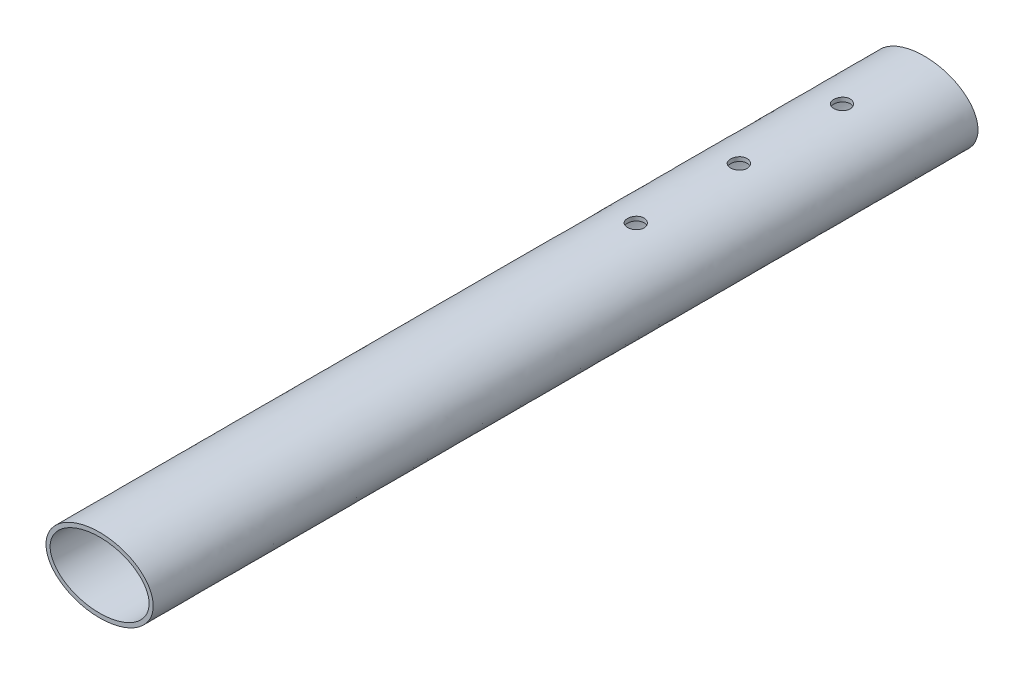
ISO-10303-21;
HEADER;
FILE_DESCRIPTION(('STEP AP214'),'2;1');
FILE_NAME('part.step','',(''),(''),'','','');
FILE_SCHEMA(('AUTOMOTIVE_DESIGN { 1 0 10303 214 1 1 1 1 }'));
ENDSEC;
DATA;
#1=APPLICATION_CONTEXT('core data for automotive mechanical design processes');
#2=APPLICATION_PROTOCOL_DEFINITION('international standard','automotive_design',2000,#1);
#3=PRODUCT_CONTEXT('',#1,'mechanical');
#4=PRODUCT('Part','Part','',(#3));
#5=PRODUCT_RELATED_PRODUCT_CATEGORY('part','',(#4));
#6=PRODUCT_DEFINITION_FORMATION('','',#4);
#7=PRODUCT_DEFINITION_CONTEXT('part definition',#1,'design');
#8=PRODUCT_DEFINITION('design','',#6,#7);
#9=PRODUCT_DEFINITION_SHAPE('','',#8);
#10=(LENGTH_UNIT() NAMED_UNIT(*) SI_UNIT(.MILLI.,.METRE.));
#11=(NAMED_UNIT(*) PLANE_ANGLE_UNIT() SI_UNIT($,.RADIAN.));
#12=(NAMED_UNIT(*) SI_UNIT($,.STERADIAN.) SOLID_ANGLE_UNIT());
#13=UNCERTAINTY_MEASURE_WITH_UNIT(LENGTH_MEASURE(1.E-05),#10,'distance_accuracy_value','');
#14=(GEOMETRIC_REPRESENTATION_CONTEXT(3) GLOBAL_UNCERTAINTY_ASSIGNED_CONTEXT((#13)) GLOBAL_UNIT_ASSIGNED_CONTEXT((#10,
#11,#12)) REPRESENTATION_CONTEXT('',''));
#15=CARTESIAN_POINT('',(0.,0.,0.));
#16=DIRECTION('',(0.,0.,1.));
#17=DIRECTION('',(1.,0.,0.));
#18=AXIS2_PLACEMENT_3D('',#15,#16,#17);
#19=CARTESIAN_POINT('',(0.,0.,200.));
#20=DIRECTION('',(0.,0.,1.));
#21=DIRECTION('',(1.,0.,0.));
#22=AXIS2_PLACEMENT_3D('',#19,#20,#21);
#23=PLANE('',#22);
#24=CARTESIAN_POINT('',(0.,0.,200.));
#25=DIRECTION('',(0.,0.,1.));
#26=DIRECTION('',(-1.,0.,0.));
#27=AXIS2_PLACEMENT_3D('',#24,#25,#26);
#28=ELLIPSE('',#27,13.,9.);
#29=CARTESIAN_POINT('',(-13.,0.,200.));
#30=VERTEX_POINT('',#29);
#31=EDGE_CURVE('E10',#30,#30,#28,.T.);
#32=ORIENTED_EDGE('',*,*,#31,.T.);
#33=EDGE_LOOP('',(#32));
#34=FACE_BOUND('',#33,.T.);
#35=CARTESIAN_POINT('',(-12.,0.,200.));
#36=CARTESIAN_POINT('',(-12.,-0.9920356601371,200.));
#37=CARTESIAN_POINT('',(-11.4421902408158,-2.9761069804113,200.));
#38=CARTESIAN_POINT('',(-8.86614178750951,-5.67990917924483,200.));
#39=CARTESIAN_POINT('',(-4.83231166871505,-7.55486933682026,200.));
#40=CARTESIAN_POINT('',(0.,-8.22256533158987,200.));
#41=CARTESIAN_POINT('',(4.83231166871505,-7.55486933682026,200.));
#42=CARTESIAN_POINT('',(8.86614178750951,-5.67990917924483,200.));
#43=CARTESIAN_POINT('',(11.4421902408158,-2.9761069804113,200.));
#44=CARTESIAN_POINT('',(12.2789048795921,0.,200.));
#45=CARTESIAN_POINT('',(11.4421902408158,2.9761069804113,200.));
#46=CARTESIAN_POINT('',(8.86614178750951,5.67990917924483,200.));
#47=CARTESIAN_POINT('',(4.83231166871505,7.55486933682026,200.));
#48=CARTESIAN_POINT('',(0.,8.22256533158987,200.));
#49=CARTESIAN_POINT('',(-4.83231166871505,7.55486933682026,200.));
#50=CARTESIAN_POINT('',(-8.86614178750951,5.67990917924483,200.));
#51=CARTESIAN_POINT('',(-11.4421902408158,2.9761069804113,200.));
#52=CARTESIAN_POINT('',(-12.,0.992035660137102,200.));
#53=CARTESIAN_POINT('',(-12.,0.,200.));
#54=B_SPLINE_CURVE_WITH_KNOTS('',3,(#35,#36,#37,#38,#39,#40,#41,#42,#43,#44,#45,#46,#47,#48,#49,
#50,#51,#52,#53),.UNSPECIFIED.,.T.,.F.,(4,1,1,1,1,1,1,1,1,1,1,1,1,1,1,1,4),(0.,
0.392699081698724,0.785398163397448,1.17809724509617,1.5707963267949,1.96349540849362,
2.35619449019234,2.74889357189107,3.14159265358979,3.53429173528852,3.92699081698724,
4.31968989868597,4.71238898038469,5.10508806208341,5.49778714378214,5.89048622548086,
6.28318530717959),.UNSPECIFIED.);
#55=CARTESIAN_POINT('',(-12.,0.,200.));
#56=VERTEX_POINT('',#55);
#57=EDGE_CURVE('E51',#56,#56,#54,.T.);
#58=ORIENTED_EDGE('',*,*,#57,.F.);
#59=EDGE_LOOP('',(#58));
#60=FACE_BOUND('',#59,.T.);
#61=ADVANCED_FACE('F32',(#34,#60),#23,.T.);
#62=CARTESIAN_POINT('',(0.,0.,0.));
#63=DIRECTION('',(0.,0.,1.));
#64=DIRECTION('',(1.,0.,0.));
#65=AXIS2_PLACEMENT_3D('',#62,#63,#64);
#66=PLANE('',#65);
#67=CARTESIAN_POINT('',(0.,0.,0.));
#68=DIRECTION('',(0.,0.,1.));
#69=DIRECTION('',(-1.,0.,0.));
#70=AXIS2_PLACEMENT_3D('',#67,#68,#69);
#71=ELLIPSE('',#70,13.,9.);
#72=CARTESIAN_POINT('',(-13.,0.,0.));
#73=VERTEX_POINT('',#72);
#74=EDGE_CURVE('E47',#73,#73,#71,.T.);
#75=ORIENTED_EDGE('',*,*,#74,.F.);
#76=EDGE_LOOP('',(#75));
#77=FACE_BOUND('',#76,.T.);
#78=CARTESIAN_POINT('',(-12.,0.,0.));
#79=CARTESIAN_POINT('',(-12.,-0.9920356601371,0.));
#80=CARTESIAN_POINT('',(-11.4421902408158,-2.9761069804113,0.));
#81=CARTESIAN_POINT('',(-8.86614178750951,-5.67990917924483,0.));
#82=CARTESIAN_POINT('',(-4.83231166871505,-7.55486933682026,0.));
#83=CARTESIAN_POINT('',(0.,-8.22256533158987,0.));
#84=CARTESIAN_POINT('',(4.83231166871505,-7.55486933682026,0.));
#85=CARTESIAN_POINT('',(8.86614178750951,-5.67990917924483,0.));
#86=CARTESIAN_POINT('',(11.4421902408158,-2.9761069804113,0.));
#87=CARTESIAN_POINT('',(12.2789048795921,0.,0.));
#88=CARTESIAN_POINT('',(11.4421902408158,2.9761069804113,0.));
#89=CARTESIAN_POINT('',(8.86614178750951,5.67990917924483,0.));
#90=CARTESIAN_POINT('',(4.83231166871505,7.55486933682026,0.));
#91=CARTESIAN_POINT('',(0.,8.22256533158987,0.));
#92=CARTESIAN_POINT('',(-4.83231166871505,7.55486933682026,0.));
#93=CARTESIAN_POINT('',(-8.86614178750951,5.67990917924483,0.));
#94=CARTESIAN_POINT('',(-11.4421902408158,2.9761069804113,0.));
#95=CARTESIAN_POINT('',(-12.,0.992035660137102,0.));
#96=CARTESIAN_POINT('',(-12.,0.,0.));
#97=B_SPLINE_CURVE_WITH_KNOTS('',3,(#78,#79,#80,#81,#82,#83,#84,#85,#86,#87,#88,#89,#90,#91,#92,
#93,#94,#95,#96),.UNSPECIFIED.,.T.,.F.,(4,1,1,1,1,1,1,1,1,1,1,1,1,1,1,1,4),(0.,
0.392699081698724,0.785398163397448,1.17809724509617,1.5707963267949,1.96349540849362,
2.35619449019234,2.74889357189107,3.14159265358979,3.53429173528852,3.92699081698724,
4.31968989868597,4.71238898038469,5.10508806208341,5.49778714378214,5.89048622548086,
6.28318530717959),.UNSPECIFIED.);
#98=CARTESIAN_POINT('',(-12.,0.,0.));
#99=VERTEX_POINT('',#98);
#100=EDGE_CURVE('E55',#99,#99,#97,.T.);
#101=ORIENTED_EDGE('',*,*,#100,.T.);
#102=EDGE_LOOP('',(#101));
#103=FACE_BOUND('',#102,.T.);
#104=ADVANCED_FACE('F117',(#77,#103),#66,.F.);
#105=DIRECTION('',(0.,0.,-1.));
#106=VECTOR('',#105,1.);
#107=SURFACE_OF_LINEAR_EXTRUSION('',#28,#106);
#108=CARTESIAN_POINT('',(0.,-9.,43.));
#109=CARTESIAN_POINT('',(-0.111999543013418,-8.99999864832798,43.0000048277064));
#110=CARTESIAN_POINT('',(-0.224072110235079,-8.99898743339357,43.0094396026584));
#111=CARTESIAN_POINT('',(-0.445107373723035,-8.99504972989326,43.0469327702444));
#112=CARTESIAN_POINT('',(-0.554066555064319,-8.99212115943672,43.0750114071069));
#113=CARTESIAN_POINT('',(-0.765642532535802,-8.98467647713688,43.1489631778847));
#114=CARTESIAN_POINT('',(-0.8682632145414,-8.98016134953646,43.1948252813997));
#115=CARTESIAN_POINT('',(-1.064328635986,-8.97004462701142,43.3030198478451));
#116=CARTESIAN_POINT('',(-1.15777513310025,-8.96444324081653,43.3653491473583));
#117=CARTESIAN_POINT('',(-1.3332401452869,-8.95275326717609,43.5049794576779));
#118=CARTESIAN_POINT('',(-1.41521621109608,-8.94666299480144,43.5823336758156));
#119=CARTESIAN_POINT('',(-1.56504873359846,-8.93469480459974,43.7497043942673));
#120=CARTESIAN_POINT('',(-1.63290451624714,-8.92881689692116,43.8397214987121));
#121=CARTESIAN_POINT('',(-1.75272513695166,-8.91792355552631,44.030134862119));
#122=CARTESIAN_POINT('',(-1.80465064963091,-8.91291026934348,44.1305560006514));
#123=CARTESIAN_POINT('',(-1.89088593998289,-8.90433816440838,44.3387548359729));
#124=CARTESIAN_POINT('',(-1.92519621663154,-8.90077930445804,44.4465323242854));
#125=CARTESIAN_POINT('',(-1.97509951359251,-8.89553757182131,44.665946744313));
#126=CARTESIAN_POINT('',(-1.99076374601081,-8.8938475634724,44.7775673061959));
#127=CARTESIAN_POINT('',(-2.00315035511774,-8.89251458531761,45.0018648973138));
#128=CARTESIAN_POINT('',(-1.99987330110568,-8.89287155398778,45.1145418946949));
#129=CARTESIAN_POINT('',(-1.97452955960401,-8.89558522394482,45.3372568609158));
#130=CARTESIAN_POINT('',(-1.95254155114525,-8.89793355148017,45.4473038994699));
#131=CARTESIAN_POINT('',(-1.89052247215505,-8.90434998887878,45.6621369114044));
#132=CARTESIAN_POINT('',(-1.8504911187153,-8.90841812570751,45.7669228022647));
#133=CARTESIAN_POINT('',(-1.75343506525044,-8.91782225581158,45.9685068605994));
#134=CARTESIAN_POINT('',(-1.69637558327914,-8.92316083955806,46.065288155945));
#135=CARTESIAN_POINT('',(-1.5669077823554,-8.93449949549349,46.2479307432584));
#136=CARTESIAN_POINT('',(-1.49449895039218,-8.94049958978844,46.3337916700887));
#137=CARTESIAN_POINT('',(-1.33595118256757,-8.95252121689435,46.492611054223));
#138=CARTESIAN_POINT('',(-1.24974463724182,-8.95854270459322,46.5655020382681));
#139=CARTESIAN_POINT('',(-1.06628301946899,-8.96990107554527,46.6957884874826));
#140=CARTESIAN_POINT('',(-0.969027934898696,-8.97523795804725,46.753183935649));
#141=CARTESIAN_POINT('',(-0.766185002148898,-8.98463050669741,46.8508465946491));
#142=CARTESIAN_POINT('',(-0.660595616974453,-8.98868593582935,46.8911106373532));
#143=CARTESIAN_POINT('',(-0.44410212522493,-8.9950593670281,46.9533194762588));
#144=CARTESIAN_POINT('',(-0.333198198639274,-8.99737742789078,46.9752648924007));
#145=CARTESIAN_POINT('',(-0.109802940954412,-9.00000959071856,47.0001282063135));
#146=CARTESIAN_POINT('',(0.00267801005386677,-9.00033341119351,47.0031383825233));
#147=CARTESIAN_POINT('',(0.226542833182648,-8.99896704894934,46.9902884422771));
#148=CARTESIAN_POINT('',(0.337926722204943,-8.9972768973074,46.974428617));
#149=CARTESIAN_POINT('',(0.556169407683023,-8.99207695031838,46.9243650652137));
#150=CARTESIAN_POINT('',(0.66303821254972,-8.98857143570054,46.8902044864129));
#151=CARTESIAN_POINT('',(0.869528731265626,-8.98013086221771,46.8045537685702));
#152=CARTESIAN_POINT('',(0.969150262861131,-8.97519576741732,46.7530631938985));
#153=CARTESIAN_POINT('',(1.15873220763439,-8.96442047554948,46.6339880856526));
#154=CARTESIAN_POINT('',(1.24865469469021,-8.9585769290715,46.5663434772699));
#155=CARTESIAN_POINT('',(1.41590201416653,-8.94664877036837,46.4169663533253));
#156=CARTESIAN_POINT('',(1.49322648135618,-8.9405641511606,46.3352334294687));
#157=CARTESIAN_POINT('',(1.63340630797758,-8.92881026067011,46.1595947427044));
#158=CARTESIAN_POINT('',(1.69620072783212,-8.92314280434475,46.065640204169));
#159=CARTESIAN_POINT('',(1.80511877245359,-8.91289572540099,45.8684646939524));
#160=CARTESIAN_POINT('',(1.85124265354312,-8.90831608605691,45.7652438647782));
#161=CARTESIAN_POINT('',(1.92540994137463,-8.90077814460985,45.5526693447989));
#162=CARTESIAN_POINT('',(1.95348878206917,-8.89781666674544,45.4433281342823));
#163=CARTESIAN_POINT('',(1.9908832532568,-8.89384354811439,45.2214494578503));
#164=CARTESIAN_POINT('',(2.00019951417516,-8.89283184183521,45.1089120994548));
#165=CARTESIAN_POINT('',(1.99979501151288,-8.89287539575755,44.8844459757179));
#166=CARTESIAN_POINT('',(1.99017068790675,-8.89392018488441,44.7725170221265));
#167=CARTESIAN_POINT('',(1.95236091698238,-8.8979355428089,44.5518761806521));
#168=CARTESIAN_POINT('',(1.92417544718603,-8.90090611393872,44.4431642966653));
#169=CARTESIAN_POINT('',(1.85007093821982,-8.90843260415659,44.2320473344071));
#170=CARTESIAN_POINT('',(1.80415520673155,-8.91298822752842,44.1296410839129));
#171=CARTESIAN_POINT('',(1.69590310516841,-8.92316894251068,43.9339726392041));
#172=CARTESIAN_POINT('',(1.63356674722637,-8.9287940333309,43.8407104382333));
#173=CARTESIAN_POINT('',(1.49388122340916,-8.94051200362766,43.6654833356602));
#174=CARTESIAN_POINT('',(1.41646009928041,-8.94660703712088,43.5835759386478));
#175=CARTESIAN_POINT('',(1.24894832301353,-8.95855790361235,43.4338751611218));
#176=CARTESIAN_POINT('',(1.15885465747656,-8.96441367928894,43.3660851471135));
#177=CARTESIAN_POINT('',(0.968273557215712,-8.97524543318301,43.2463898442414));
#178=CARTESIAN_POINT('',(0.867757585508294,-8.98021888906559,43.1945297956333));
#179=CARTESIAN_POINT('',(0.659453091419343,-8.98870198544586,43.1084947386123));
#180=CARTESIAN_POINT('',(0.55167284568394,-8.99221326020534,43.0742999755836));
#181=CARTESIAN_POINT('',(0.369412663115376,-8.99650621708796,43.0330069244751));
#182=CARTESIAN_POINT('',(0.296094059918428,-8.99781026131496,43.0206464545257));
#183=CARTESIAN_POINT('',(0.148527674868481,-8.99955759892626,43.0041414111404));
#184=CARTESIAN_POINT('',(0.0742798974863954,-9.00000089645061,42.9999967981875));
#185=CARTESIAN_POINT('',(0.,-9.,43.));
#186=B_SPLINE_CURVE_WITH_KNOTS('',3,(#108,#109,#110,#111,#112,#113,#114,#115,#116,#117,#118,
#119,#120,#121,#122,#123,#124,#125,#126,#127,#128,#129,#130,#131,#132,#133,#134,#135,#136,#137,
#138,#139,#140,#141,#142,#143,#144,#145,#146,#147,#148,#149,#150,#151,#152,#153,#154,#155,#156,
#157,#158,#159,#160,#161,#162,#163,#164,#165,#166,#167,#168,#169,#170,#171,#172,#173,#174,#175,
#176,#177,#178,#179,#180,#181,#182,#183,#184,#185),.UNSPECIFIED.,.T.,.F.,(4,2,2,2,2,2,2,2,2,2,2,
2,2,2,2,2,2,2,2,2,2,2,2,2,2,2,2,2,2,2,2,2,2,2,2,2,2,2,4),(0.,0.335727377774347,
0.671819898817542,1.00770428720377,1.34352419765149,1.68055576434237,2.01760341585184,
2.35547652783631,2.69334006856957,3.02990907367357,3.36646796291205,3.70161858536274,
4.03677446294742,4.37261967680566,4.70847611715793,5.04603170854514,5.38358767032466,
5.72120602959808,6.05881296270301,6.39477332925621,6.73072851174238,7.06589507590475,
7.4010700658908,7.73751149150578,8.07396266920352,8.41180034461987,8.74963282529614,
9.08679988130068,9.42395560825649,9.75939907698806,10.0948429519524,10.4302242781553,
10.7656053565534,11.1026272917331,11.4397295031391,11.7777803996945,12.1154524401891,
12.3381133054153,12.5607730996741),.UNSPECIFIED.);
#187=CARTESIAN_POINT('',(0.,-9.,43.));
#188=VERTEX_POINT('',#187);
#189=EDGE_CURVE('E68',#188,#188,#186,.T.);
#190=ORIENTED_EDGE('',*,*,#189,.T.);
#191=EDGE_LOOP('',(#190));
#192=FACE_BOUND('',#191,.T.);
#193=CARTESIAN_POINT('',(0.,9.,43.));
#194=CARTESIAN_POINT('',(0.111999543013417,8.99999864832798,43.0000048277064));
#195=CARTESIAN_POINT('',(0.224072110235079,8.99898743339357,43.0094396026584));
#196=CARTESIAN_POINT('',(0.445107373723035,8.99504972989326,43.0469327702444));
#197=CARTESIAN_POINT('',(0.55406655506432,8.99212115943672,43.0750114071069));
#198=CARTESIAN_POINT('',(0.765642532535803,8.98467647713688,43.1489631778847));
#199=CARTESIAN_POINT('',(0.868263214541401,8.98016134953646,43.1948252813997));
#200=CARTESIAN_POINT('',(1.064328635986,8.97004462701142,43.3030198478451));
#201=CARTESIAN_POINT('',(1.15777513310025,8.96444324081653,43.3653491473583));
#202=CARTESIAN_POINT('',(1.3332401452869,8.95275326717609,43.5049794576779));
#203=CARTESIAN_POINT('',(1.41521621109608,8.94666299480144,43.5823336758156));
#204=CARTESIAN_POINT('',(1.56504873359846,8.93469480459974,43.7497043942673));
#205=CARTESIAN_POINT('',(1.63290451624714,8.92881689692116,43.8397214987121));
#206=CARTESIAN_POINT('',(1.75272513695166,8.91792355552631,44.030134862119));
#207=CARTESIAN_POINT('',(1.80465064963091,8.91291026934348,44.1305560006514));
#208=CARTESIAN_POINT('',(1.89088593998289,8.90433816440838,44.3387548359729));
#209=CARTESIAN_POINT('',(1.92519621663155,8.90077930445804,44.4465323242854));
#210=CARTESIAN_POINT('',(1.97509951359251,8.89553757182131,44.665946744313));
#211=CARTESIAN_POINT('',(1.99076374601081,8.8938475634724,44.7775673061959));
#212=CARTESIAN_POINT('',(2.00315035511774,8.89251458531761,45.0018648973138));
#213=CARTESIAN_POINT('',(1.99987330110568,8.89287155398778,45.1145418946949));
#214=CARTESIAN_POINT('',(1.97452955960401,8.89558522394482,45.3372568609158));
#215=CARTESIAN_POINT('',(1.95254155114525,8.89793355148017,45.4473038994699));
#216=CARTESIAN_POINT('',(1.89052247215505,8.90434998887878,45.6621369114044));
#217=CARTESIAN_POINT('',(1.85049111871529,8.90841812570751,45.7669228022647));
#218=CARTESIAN_POINT('',(1.75343506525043,8.91782225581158,45.9685068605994));
#219=CARTESIAN_POINT('',(1.69637558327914,8.92316083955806,46.065288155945));
#220=CARTESIAN_POINT('',(1.5669077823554,8.93449949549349,46.2479307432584));
#221=CARTESIAN_POINT('',(1.49449895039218,8.94049958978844,46.3337916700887));
#222=CARTESIAN_POINT('',(1.33595118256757,8.95252121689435,46.492611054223));
#223=CARTESIAN_POINT('',(1.24974463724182,8.95854270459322,46.5655020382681));
#224=CARTESIAN_POINT('',(1.06628301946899,8.96990107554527,46.6957884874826));
#225=CARTESIAN_POINT('',(0.969027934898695,8.97523795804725,46.753183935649));
#226=CARTESIAN_POINT('',(0.766185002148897,8.98463050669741,46.8508465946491));
#227=CARTESIAN_POINT('',(0.660595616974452,8.98868593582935,46.8911106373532));
#228=CARTESIAN_POINT('',(0.44410212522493,8.9950593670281,46.9533194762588));
#229=CARTESIAN_POINT('',(0.333198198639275,8.99737742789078,46.9752648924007));
#230=CARTESIAN_POINT('',(0.109802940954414,9.00000959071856,47.0001282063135));
#231=CARTESIAN_POINT('',(-0.00267801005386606,9.00033341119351,47.0031383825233));
#232=CARTESIAN_POINT('',(-0.226542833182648,8.99896704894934,46.9902884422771));
#233=CARTESIAN_POINT('',(-0.337926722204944,8.9972768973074,46.974428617));
#234=CARTESIAN_POINT('',(-0.556169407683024,8.99207695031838,46.9243650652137));
#235=CARTESIAN_POINT('',(-0.663038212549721,8.98857143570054,46.8902044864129));
#236=CARTESIAN_POINT('',(-0.869528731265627,8.98013086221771,46.8045537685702));
#237=CARTESIAN_POINT('',(-0.969150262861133,8.97519576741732,46.7530631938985));
#238=CARTESIAN_POINT('',(-1.15873220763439,8.96442047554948,46.6339880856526));
#239=CARTESIAN_POINT('',(-1.24865469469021,8.9585769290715,46.5663434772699));
#240=CARTESIAN_POINT('',(-1.41590201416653,8.94664877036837,46.4169663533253));
#241=CARTESIAN_POINT('',(-1.49322648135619,8.94056415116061,46.3352334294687));
#242=CARTESIAN_POINT('',(-1.63340630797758,8.92881026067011,46.1595947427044));
#243=CARTESIAN_POINT('',(-1.69620072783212,8.92314280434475,46.065640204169));
#244=CARTESIAN_POINT('',(-1.80511877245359,8.91289572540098,45.8684646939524));
#245=CARTESIAN_POINT('',(-1.85124265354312,8.90831608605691,45.7652438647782));
#246=CARTESIAN_POINT('',(-1.92540994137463,8.90077814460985,45.5526693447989));
#247=CARTESIAN_POINT('',(-1.95348878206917,8.89781666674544,45.4433281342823));
#248=CARTESIAN_POINT('',(-1.9908832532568,8.89384354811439,45.2214494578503));
#249=CARTESIAN_POINT('',(-2.00019951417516,8.89283184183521,45.1089120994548));
#250=CARTESIAN_POINT('',(-1.99979501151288,8.89287539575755,44.8844459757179));
#251=CARTESIAN_POINT('',(-1.99017068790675,8.89392018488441,44.7725170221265));
#252=CARTESIAN_POINT('',(-1.95236091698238,8.8979355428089,44.5518761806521));
#253=CARTESIAN_POINT('',(-1.92417544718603,8.90090611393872,44.4431642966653));
#254=CARTESIAN_POINT('',(-1.85007093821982,8.90843260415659,44.2320473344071));
#255=CARTESIAN_POINT('',(-1.80415520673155,8.91298822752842,44.1296410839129));
#256=CARTESIAN_POINT('',(-1.69590310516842,8.92316894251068,43.9339726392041));
#257=CARTESIAN_POINT('',(-1.63356674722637,8.9287940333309,43.8407104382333));
#258=CARTESIAN_POINT('',(-1.49388122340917,8.94051200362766,43.6654833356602));
#259=CARTESIAN_POINT('',(-1.41646009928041,8.94660703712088,43.5835759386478));
#260=CARTESIAN_POINT('',(-1.24894832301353,8.95855790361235,43.4338751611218));
#261=CARTESIAN_POINT('',(-1.15885465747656,8.96441367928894,43.3660851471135));
#262=CARTESIAN_POINT('',(-0.968273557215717,8.97524543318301,43.2463898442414));
#263=CARTESIAN_POINT('',(-0.867757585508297,8.98021888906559,43.1945297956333));
#264=CARTESIAN_POINT('',(-0.659453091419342,8.98870198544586,43.1084947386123));
#265=CARTESIAN_POINT('',(-0.551672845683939,8.99221326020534,43.0742999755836));
#266=CARTESIAN_POINT('',(-0.369412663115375,8.99650621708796,43.0330069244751));
#267=CARTESIAN_POINT('',(-0.296094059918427,8.99781026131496,43.0206464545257));
#268=CARTESIAN_POINT('',(-0.148527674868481,8.99955759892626,43.0041414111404));
#269=CARTESIAN_POINT('',(-0.0742798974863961,9.00000089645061,42.9999967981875));
#270=CARTESIAN_POINT('',(0.,9.,43.));
#271=B_SPLINE_CURVE_WITH_KNOTS('',3,(#193,#194,#195,#196,#197,#198,#199,#200,#201,#202,#203,
#204,#205,#206,#207,#208,#209,#210,#211,#212,#213,#214,#215,#216,#217,#218,#219,#220,#221,#222,
#223,#224,#225,#226,#227,#228,#229,#230,#231,#232,#233,#234,#235,#236,#237,#238,#239,#240,#241,
#242,#243,#244,#245,#246,#247,#248,#249,#250,#251,#252,#253,#254,#255,#256,#257,#258,#259,#260,
#261,#262,#263,#264,#265,#266,#267,#268,#269,#270),.UNSPECIFIED.,.T.,.F.,(4,2,2,2,2,2,2,2,2,2,2,
2,2,2,2,2,2,2,2,2,2,2,2,2,2,2,2,2,2,2,2,2,2,2,2,2,2,2,4),(0.,0.335727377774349,
0.671819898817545,1.00770428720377,1.34352419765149,1.68055576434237,2.01760341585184,
2.35547652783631,2.69334006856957,3.02990907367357,3.36646796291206,3.70161858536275,
4.03677446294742,4.37261967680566,4.70847611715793,5.04603170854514,5.38358767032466,
5.72120602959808,6.05881296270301,6.39477332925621,6.73072851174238,7.06589507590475,
7.4010700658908,7.73751149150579,8.07396266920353,8.41180034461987,8.74963282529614,
9.08679988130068,9.42395560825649,9.75939907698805,10.0948429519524,10.4302242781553,
10.7656053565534,11.102627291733,11.4397295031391,11.7777803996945,12.1154524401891,
12.3381133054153,12.5607730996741),.UNSPECIFIED.);
#272=CARTESIAN_POINT('',(0.,9.,43.));
#273=VERTEX_POINT('',#272);
#274=EDGE_CURVE('E201',#273,#273,#271,.T.);
#275=ORIENTED_EDGE('',*,*,#274,.T.);
#276=EDGE_LOOP('',(#275));
#277=FACE_BOUND('',#276,.T.);
#278=CARTESIAN_POINT('',(0.,-9.,68.));
#279=CARTESIAN_POINT('',(-0.111999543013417,-8.99999864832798,68.0000048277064));
#280=CARTESIAN_POINT('',(-0.224072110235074,-8.99898743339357,68.0094396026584));
#281=CARTESIAN_POINT('',(-0.445107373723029,-8.99504972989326,68.0469327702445));
#282=CARTESIAN_POINT('',(-0.554066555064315,-8.99212115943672,68.075011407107));
#283=CARTESIAN_POINT('',(-0.765642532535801,-8.98467647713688,68.1489631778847));
#284=CARTESIAN_POINT('',(-0.8682632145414,-8.98016134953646,68.1948252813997));
#285=CARTESIAN_POINT('',(-1.064328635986,-8.97004462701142,68.3030198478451));
#286=CARTESIAN_POINT('',(-1.15777513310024,-8.96444324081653,68.3653491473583));
#287=CARTESIAN_POINT('',(-1.33324014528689,-8.95275326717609,68.504979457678));
#288=CARTESIAN_POINT('',(-1.41521621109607,-8.94666299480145,68.5823336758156));
#289=CARTESIAN_POINT('',(-1.56504873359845,-8.93469480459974,68.7497043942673));
#290=CARTESIAN_POINT('',(-1.63290451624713,-8.92881689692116,68.8397214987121));
#291=CARTESIAN_POINT('',(-1.75272513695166,-8.9179235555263,69.030134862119));
#292=CARTESIAN_POINT('',(-1.80465064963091,-8.91291026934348,69.1305560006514));
#293=CARTESIAN_POINT('',(-1.89088593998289,-8.90433816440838,69.3387548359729));
#294=CARTESIAN_POINT('',(-1.92519621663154,-8.90077930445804,69.4465323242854));
#295=CARTESIAN_POINT('',(-1.97509951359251,-8.89553757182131,69.665946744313));
#296=CARTESIAN_POINT('',(-1.99076374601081,-8.8938475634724,69.7775673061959));
#297=CARTESIAN_POINT('',(-2.00315035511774,-8.89251458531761,70.0018648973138));
#298=CARTESIAN_POINT('',(-1.99987330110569,-8.89287155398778,70.1145418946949));
#299=CARTESIAN_POINT('',(-1.97452955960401,-8.89558522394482,70.3372568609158));
#300=CARTESIAN_POINT('',(-1.95254155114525,-8.89793355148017,70.4473038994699));
#301=CARTESIAN_POINT('',(-1.89052247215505,-8.90434998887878,70.6621369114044));
#302=CARTESIAN_POINT('',(-1.8504911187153,-8.90841812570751,70.7669228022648));
#303=CARTESIAN_POINT('',(-1.75343506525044,-8.91782225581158,70.9685068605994));
#304=CARTESIAN_POINT('',(-1.69637558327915,-8.92316083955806,71.065288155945));
#305=CARTESIAN_POINT('',(-1.56690778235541,-8.93449949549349,71.2479307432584));
#306=CARTESIAN_POINT('',(-1.49449895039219,-8.94049958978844,71.3337916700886));
#307=CARTESIAN_POINT('',(-1.33595118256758,-8.95252121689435,71.492611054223));
#308=CARTESIAN_POINT('',(-1.24974463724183,-8.95854270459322,71.5655020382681));
#309=CARTESIAN_POINT('',(-1.06628301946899,-8.96990107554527,71.6957884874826));
#310=CARTESIAN_POINT('',(-0.969027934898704,-8.97523795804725,71.753183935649));
#311=CARTESIAN_POINT('',(-0.766185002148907,-8.98463050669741,71.8508465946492));
#312=CARTESIAN_POINT('',(-0.660595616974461,-8.98868593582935,71.8911106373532));
#313=CARTESIAN_POINT('',(-0.444102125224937,-8.9950593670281,71.9533194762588));
#314=CARTESIAN_POINT('',(-0.333198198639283,-8.99737742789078,71.9752648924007));
#315=CARTESIAN_POINT('',(-0.109802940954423,-9.00000959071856,72.0001282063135));
#316=CARTESIAN_POINT('',(0.00267801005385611,-9.00033341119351,72.0031383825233));
#317=CARTESIAN_POINT('',(0.226542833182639,-8.99896704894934,71.9902884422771));
#318=CARTESIAN_POINT('',(0.337926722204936,-8.9972768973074,71.9744286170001));
#319=CARTESIAN_POINT('',(0.556169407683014,-8.99207695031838,71.9243650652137));
#320=CARTESIAN_POINT('',(0.663038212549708,-8.98857143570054,71.8902044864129));
#321=CARTESIAN_POINT('',(0.869528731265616,-8.98013086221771,71.8045537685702));
#322=CARTESIAN_POINT('',(0.969150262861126,-8.97519576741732,71.7530631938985));
#323=CARTESIAN_POINT('',(1.15873220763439,-8.96442047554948,71.6339880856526));
#324=CARTESIAN_POINT('',(1.2486546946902,-8.9585769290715,71.5663434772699));
#325=CARTESIAN_POINT('',(1.41590201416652,-8.94664877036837,71.4169663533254));
#326=CARTESIAN_POINT('',(1.49322648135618,-8.94056415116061,71.3352334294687));
#327=CARTESIAN_POINT('',(1.63340630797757,-8.92881026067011,71.1595947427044));
#328=CARTESIAN_POINT('',(1.69620072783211,-8.92314280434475,71.065640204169));
#329=CARTESIAN_POINT('',(1.80511877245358,-8.91289572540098,70.8684646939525));
#330=CARTESIAN_POINT('',(1.85124265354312,-8.90831608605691,70.7652438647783));
#331=CARTESIAN_POINT('',(1.92540994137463,-8.90077814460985,70.5526693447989));
#332=CARTESIAN_POINT('',(1.95348878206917,-8.89781666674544,70.4433281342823));
#333=CARTESIAN_POINT('',(1.9908832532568,-8.89384354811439,70.2214494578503));
#334=CARTESIAN_POINT('',(2.00019951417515,-8.89283184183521,70.1089120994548));
#335=CARTESIAN_POINT('',(1.99979501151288,-8.89287539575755,69.884445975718));
#336=CARTESIAN_POINT('',(1.99017068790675,-8.89392018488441,69.7725170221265));
#337=CARTESIAN_POINT('',(1.95236091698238,-8.8979355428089,69.5518761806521));
#338=CARTESIAN_POINT('',(1.92417544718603,-8.90090611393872,69.4431642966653));
#339=CARTESIAN_POINT('',(1.85007093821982,-8.90843260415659,69.2320473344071));
#340=CARTESIAN_POINT('',(1.80415520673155,-8.91298822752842,69.1296410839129));
#341=CARTESIAN_POINT('',(1.69590310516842,-8.92316894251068,68.9339726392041));
#342=CARTESIAN_POINT('',(1.63356674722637,-8.9287940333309,68.8407104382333));
#343=CARTESIAN_POINT('',(1.49388122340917,-8.94051200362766,68.6654833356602));
#344=CARTESIAN_POINT('',(1.41646009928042,-8.94660703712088,68.5835759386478));
#345=CARTESIAN_POINT('',(1.24894832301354,-8.95855790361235,68.4338751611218));
#346=CARTESIAN_POINT('',(1.15885465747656,-8.96441367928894,68.3660851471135));
#347=CARTESIAN_POINT('',(0.968273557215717,-8.97524543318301,68.2463898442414));
#348=CARTESIAN_POINT('',(0.867757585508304,-8.98021888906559,68.1945297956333));
#349=CARTESIAN_POINT('',(0.659453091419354,-8.98870198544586,68.1084947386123));
#350=CARTESIAN_POINT('',(0.551672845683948,-8.99221326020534,68.0742999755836));
#351=CARTESIAN_POINT('',(0.369412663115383,-8.99650621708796,68.0330069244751));
#352=CARTESIAN_POINT('',(0.296094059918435,-8.99781026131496,68.0206464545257));
#353=CARTESIAN_POINT('',(0.148527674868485,-8.99955759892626,68.0041414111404));
#354=CARTESIAN_POINT('',(0.0742798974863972,-9.00000089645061,67.9999967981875));
#355=CARTESIAN_POINT('',(0.,-9.,68.));
#356=B_SPLINE_CURVE_WITH_KNOTS('',3,(#278,#279,#280,#281,#282,#283,#284,#285,#286,#287,#288,
#289,#290,#291,#292,#293,#294,#295,#296,#297,#298,#299,#300,#301,#302,#303,#304,#305,#306,#307,
#308,#309,#310,#311,#312,#313,#314,#315,#316,#317,#318,#319,#320,#321,#322,#323,#324,#325,#326,
#327,#328,#329,#330,#331,#332,#333,#334,#335,#336,#337,#338,#339,#340,#341,#342,#343,#344,#345,
#346,#347,#348,#349,#350,#351,#352,#353,#354,#355),.UNSPECIFIED.,.T.,.F.,(4,2,2,2,2,2,2,2,2,2,2,
2,2,2,2,2,2,2,2,2,2,2,2,2,2,2,2,2,2,2,2,2,2,2,2,2,2,2,4),(0.,0.335727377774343,
0.671819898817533,1.00770428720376,1.34352419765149,1.68055576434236,2.01760341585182,
2.35547652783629,2.69334006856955,3.02990907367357,3.36646796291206,3.70161858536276,
4.03677446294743,4.37261967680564,4.70847611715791,5.04603170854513,5.38358767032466,
5.72120602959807,6.058812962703,6.3947733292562,6.73072851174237,7.06589507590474,
7.40107006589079,7.73751149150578,8.07396266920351,8.41180034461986,8.74963282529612,
9.08679988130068,9.42395560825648,9.75939907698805,10.0948429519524,10.4302242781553,
10.7656053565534,11.102627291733,11.4397295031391,11.7777803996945,12.1154524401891,
12.3381133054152,12.5607730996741),.UNSPECIFIED.);
#357=CARTESIAN_POINT('',(0.,-9.,68.));
#358=VERTEX_POINT('',#357);
#359=EDGE_CURVE('E207',#358,#358,#356,.T.);
#360=ORIENTED_EDGE('',*,*,#359,.T.);
#361=EDGE_LOOP('',(#360));
#362=FACE_BOUND('',#361,.T.);
#363=CARTESIAN_POINT('',(0.,9.,68.));
#364=CARTESIAN_POINT('',(0.111999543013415,8.99999864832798,68.0000048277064));
#365=CARTESIAN_POINT('',(0.224072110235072,8.99898743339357,68.0094396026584));
#366=CARTESIAN_POINT('',(0.445107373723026,8.99504972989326,68.0469327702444));
#367=CARTESIAN_POINT('',(0.55406655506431,8.99212115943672,68.075011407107));
#368=CARTESIAN_POINT('',(0.765642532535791,8.98467647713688,68.1489631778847));
#369=CARTESIAN_POINT('',(0.868263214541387,8.98016134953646,68.1948252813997));
#370=CARTESIAN_POINT('',(1.06432863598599,8.97004462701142,68.3030198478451));
#371=CARTESIAN_POINT('',(1.15777513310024,8.96444324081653,68.3653491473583));
#372=CARTESIAN_POINT('',(1.33324014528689,8.95275326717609,68.5049794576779));
#373=CARTESIAN_POINT('',(1.41521621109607,8.94666299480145,68.5823336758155));
#374=CARTESIAN_POINT('',(1.56504873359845,8.93469480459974,68.7497043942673));
#375=CARTESIAN_POINT('',(1.63290451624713,8.92881689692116,68.8397214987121));
#376=CARTESIAN_POINT('',(1.75272513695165,8.91792355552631,69.030134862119));
#377=CARTESIAN_POINT('',(1.8046506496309,8.91291026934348,69.1305560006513));
#378=CARTESIAN_POINT('',(1.89088593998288,8.90433816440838,69.3387548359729));
#379=CARTESIAN_POINT('',(1.92519621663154,8.90077930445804,69.4465323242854));
#380=CARTESIAN_POINT('',(1.9750995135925,8.89553757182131,69.665946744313));
#381=CARTESIAN_POINT('',(1.9907637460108,8.8938475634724,69.7775673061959));
#382=CARTESIAN_POINT('',(2.00315035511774,8.89251458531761,70.0018648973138));
#383=CARTESIAN_POINT('',(1.99987330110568,8.89287155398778,70.1145418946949));
#384=CARTESIAN_POINT('',(1.97452955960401,8.89558522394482,70.3372568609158));
#385=CARTESIAN_POINT('',(1.95254155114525,8.89793355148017,70.4473038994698));
#386=CARTESIAN_POINT('',(1.89052247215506,8.90434998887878,70.6621369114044));
#387=CARTESIAN_POINT('',(1.85049111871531,8.90841812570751,70.7669228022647));
#388=CARTESIAN_POINT('',(1.75343506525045,8.91782225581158,70.9685068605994));
#389=CARTESIAN_POINT('',(1.69637558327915,8.92316083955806,71.065288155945));
#390=CARTESIAN_POINT('',(1.56690778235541,8.93449949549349,71.2479307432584));
#391=CARTESIAN_POINT('',(1.49449895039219,8.94049958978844,71.3337916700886));
#392=CARTESIAN_POINT('',(1.33595118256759,8.95252121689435,71.492611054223));
#393=CARTESIAN_POINT('',(1.24974463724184,8.95854270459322,71.5655020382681));
#394=CARTESIAN_POINT('',(1.066283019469,8.96990107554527,71.6957884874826));
#395=CARTESIAN_POINT('',(0.969027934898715,8.97523795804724,71.753183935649));
#396=CARTESIAN_POINT('',(0.766185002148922,8.9846305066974,71.8508465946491));
#397=CARTESIAN_POINT('',(0.660595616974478,8.98868593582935,71.8911106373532));
#398=CARTESIAN_POINT('',(0.444102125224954,8.9950593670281,71.9533194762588));
#399=CARTESIAN_POINT('',(0.333198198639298,8.99737742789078,71.9752648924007));
#400=CARTESIAN_POINT('',(0.109802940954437,9.00000959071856,72.0001282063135));
#401=CARTESIAN_POINT('',(-0.00267801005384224,9.00033341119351,72.0031383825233));
#402=CARTESIAN_POINT('',(-0.226542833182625,8.99896704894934,71.9902884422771));
#403=CARTESIAN_POINT('',(-0.337926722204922,8.9972768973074,71.9744286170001));
#404=CARTESIAN_POINT('',(-0.556169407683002,8.99207695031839,71.9243650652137));
#405=CARTESIAN_POINT('',(-0.663038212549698,8.98857143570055,71.8902044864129));
#406=CARTESIAN_POINT('',(-0.869528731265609,8.98013086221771,71.8045537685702));
#407=CARTESIAN_POINT('',(-0.96915026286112,8.97519576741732,71.7530631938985));
#408=CARTESIAN_POINT('',(-1.15873220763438,8.96442047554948,71.6339880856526));
#409=CARTESIAN_POINT('',(-1.2486546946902,8.9585769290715,71.5663434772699));
#410=CARTESIAN_POINT('',(-1.41590201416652,8.94664877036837,71.4169663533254));
#411=CARTESIAN_POINT('',(-1.49322648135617,8.94056415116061,71.3352334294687));
#412=CARTESIAN_POINT('',(-1.63340630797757,8.92881026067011,71.1595947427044));
#413=CARTESIAN_POINT('',(-1.69620072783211,8.92314280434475,71.065640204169));
#414=CARTESIAN_POINT('',(-1.80511877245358,8.91289572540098,70.8684646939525));
#415=CARTESIAN_POINT('',(-1.85124265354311,8.90831608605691,70.7652438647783));
#416=CARTESIAN_POINT('',(-1.92540994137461,8.90077814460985,70.5526693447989));
#417=CARTESIAN_POINT('',(-1.95348878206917,8.89781666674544,70.4433281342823));
#418=CARTESIAN_POINT('',(-1.9908832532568,8.89384354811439,70.2214494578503));
#419=CARTESIAN_POINT('',(-2.00019951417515,8.89283184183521,70.1089120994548));
#420=CARTESIAN_POINT('',(-1.99979501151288,8.89287539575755,69.884445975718));
#421=CARTESIAN_POINT('',(-1.99017068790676,8.89392018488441,69.7725170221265));
#422=CARTESIAN_POINT('',(-1.95236091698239,8.8979355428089,69.5518761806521));
#423=CARTESIAN_POINT('',(-1.92417544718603,8.90090611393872,69.4431642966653));
#424=CARTESIAN_POINT('',(-1.85007093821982,8.90843260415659,69.2320473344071));
#425=CARTESIAN_POINT('',(-1.80415520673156,8.91298822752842,69.1296410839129));
#426=CARTESIAN_POINT('',(-1.69590310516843,8.92316894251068,68.9339726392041));
#427=CARTESIAN_POINT('',(-1.63356674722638,8.9287940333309,68.8407104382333));
#428=CARTESIAN_POINT('',(-1.49388122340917,8.94051200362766,68.6654833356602));
#429=CARTESIAN_POINT('',(-1.41646009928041,8.94660703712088,68.5835759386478));
#430=CARTESIAN_POINT('',(-1.24894832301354,8.95855790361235,68.4338751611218));
#431=CARTESIAN_POINT('',(-1.15885465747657,8.96441367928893,68.3660851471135));
#432=CARTESIAN_POINT('',(-0.968273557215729,8.97524543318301,68.2463898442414));
#433=CARTESIAN_POINT('',(-0.867757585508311,8.98021888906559,68.1945297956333));
#434=CARTESIAN_POINT('',(-0.65945309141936,8.98870198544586,68.1084947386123));
#435=CARTESIAN_POINT('',(-0.551672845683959,8.99221326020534,68.0742999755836));
#436=CARTESIAN_POINT('',(-0.369412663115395,8.99650621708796,68.0330069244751));
#437=CARTESIAN_POINT('',(-0.296094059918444,8.99781026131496,68.0206464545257));
#438=CARTESIAN_POINT('',(-0.148527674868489,8.99955759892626,68.0041414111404));
#439=CARTESIAN_POINT('',(-0.0742798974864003,9.00000089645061,67.9999967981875));
#440=CARTESIAN_POINT('',(0.,9.,68.));
#441=B_SPLINE_CURVE_WITH_KNOTS('',3,(#363,#364,#365,#366,#367,#368,#369,#370,#371,#372,#373,
#374,#375,#376,#377,#378,#379,#380,#381,#382,#383,#384,#385,#386,#387,#388,#389,#390,#391,#392,
#393,#394,#395,#396,#397,#398,#399,#400,#401,#402,#403,#404,#405,#406,#407,#408,#409,#410,#411,
#412,#413,#414,#415,#416,#417,#418,#419,#420,#421,#422,#423,#424,#425,#426,#427,#428,#429,#430,
#431,#432,#433,#434,#435,#436,#437,#438,#439,#440),.UNSPECIFIED.,.T.,.F.,(4,2,2,2,2,2,2,2,2,2,2,
2,2,2,2,2,2,2,2,2,2,2,2,2,2,2,2,2,2,2,2,2,2,2,2,2,2,2,4),(0.,0.33572737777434,0.67181989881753,
1.00770428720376,1.34352419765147,1.68055576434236,2.01760341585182,2.35547652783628,
2.69334006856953,3.02990907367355,3.36646796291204,3.70161858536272,4.0367744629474,
4.37261967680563,4.70847611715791,5.04603170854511,5.38358767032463,5.72120602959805,
6.05881296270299,6.39477332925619,6.73072851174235,7.06589507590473,7.40107006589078,
7.73751149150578,8.0739626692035,8.41180034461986,8.74963282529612,9.08679988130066,
9.42395560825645,9.75939907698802,10.0948429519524,10.4302242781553,10.7656053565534,
11.102627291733,11.4397295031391,11.7777803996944,12.1154524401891,12.3381133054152,
12.5607730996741),.UNSPECIFIED.);
#442=CARTESIAN_POINT('',(0.,9.,68.));
#443=VERTEX_POINT('',#442);
#444=EDGE_CURVE('E213',#443,#443,#441,.T.);
#445=ORIENTED_EDGE('',*,*,#444,.T.);
#446=EDGE_LOOP('',(#445));
#447=FACE_BOUND('',#446,.T.);
#448=CARTESIAN_POINT('',(0.,-9.,18.));
#449=CARTESIAN_POINT('',(-0.111999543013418,-8.99999864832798,18.0000048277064));
#450=CARTESIAN_POINT('',(-0.224072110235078,-8.99898743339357,18.0094396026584));
#451=CARTESIAN_POINT('',(-0.445107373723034,-8.99504972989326,18.0469327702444));
#452=CARTESIAN_POINT('',(-0.554066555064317,-8.99212115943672,18.075011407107));
#453=CARTESIAN_POINT('',(-0.765642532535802,-8.98467647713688,18.1489631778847));
#454=CARTESIAN_POINT('',(-0.868263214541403,-8.98016134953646,18.1948252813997));
#455=CARTESIAN_POINT('',(-1.06432863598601,-8.97004462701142,18.3030198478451));
#456=CARTESIAN_POINT('',(-1.15777513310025,-8.96444324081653,18.3653491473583));
#457=CARTESIAN_POINT('',(-1.3332401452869,-8.95275326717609,18.5049794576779));
#458=CARTESIAN_POINT('',(-1.41521621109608,-8.94666299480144,18.5823336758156));
#459=CARTESIAN_POINT('',(-1.56504873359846,-8.93469480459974,18.7497043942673));
#460=CARTESIAN_POINT('',(-1.63290451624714,-8.92881689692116,18.8397214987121));
#461=CARTESIAN_POINT('',(-1.75272513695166,-8.91792355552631,19.030134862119));
#462=CARTESIAN_POINT('',(-1.80465064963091,-8.91291026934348,19.1305560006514));
#463=CARTESIAN_POINT('',(-1.89088593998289,-8.90433816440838,19.3387548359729));
#464=CARTESIAN_POINT('',(-1.92519621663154,-8.90077930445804,19.4465323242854));
#465=CARTESIAN_POINT('',(-1.97509951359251,-8.89553757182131,19.665946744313));
#466=CARTESIAN_POINT('',(-1.99076374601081,-8.8938475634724,19.7775673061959));
#467=CARTESIAN_POINT('',(-2.00315035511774,-8.89251458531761,20.0018648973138));
#468=CARTESIAN_POINT('',(-1.99987330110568,-8.89287155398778,20.1145418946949));
#469=CARTESIAN_POINT('',(-1.97452955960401,-8.89558522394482,20.3372568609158));
#470=CARTESIAN_POINT('',(-1.95254155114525,-8.89793355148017,20.4473038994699));
#471=CARTESIAN_POINT('',(-1.89052247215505,-8.90434998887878,20.6621369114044));
#472=CARTESIAN_POINT('',(-1.85049111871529,-8.90841812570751,20.7669228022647));
#473=CARTESIAN_POINT('',(-1.75343506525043,-8.91782225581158,20.9685068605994));
#474=CARTESIAN_POINT('',(-1.69637558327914,-8.92316083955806,21.065288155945));
#475=CARTESIAN_POINT('',(-1.5669077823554,-8.93449949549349,21.2479307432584));
#476=CARTESIAN_POINT('',(-1.49449895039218,-8.94049958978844,21.3337916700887));
#477=CARTESIAN_POINT('',(-1.33595118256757,-8.95252121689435,21.492611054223));
#478=CARTESIAN_POINT('',(-1.24974463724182,-8.95854270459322,21.5655020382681));
#479=CARTESIAN_POINT('',(-1.06628301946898,-8.96990107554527,21.6957884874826));
#480=CARTESIAN_POINT('',(-0.969027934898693,-8.97523795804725,21.753183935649));
#481=CARTESIAN_POINT('',(-0.766185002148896,-8.98463050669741,21.8508465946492));
#482=CARTESIAN_POINT('',(-0.660595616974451,-8.98868593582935,21.8911106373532));
#483=CARTESIAN_POINT('',(-0.444102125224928,-8.9950593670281,21.9533194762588));
#484=CARTESIAN_POINT('',(-0.333198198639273,-8.99737742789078,21.9752648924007));
#485=CARTESIAN_POINT('',(-0.109802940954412,-9.00000959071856,22.0001282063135));
#486=CARTESIAN_POINT('',(0.00267801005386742,-9.00033341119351,22.0031383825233));
#487=CARTESIAN_POINT('',(0.22654283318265,-8.99896704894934,21.9902884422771));
#488=CARTESIAN_POINT('',(0.337926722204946,-8.9972768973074,21.974428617));
#489=CARTESIAN_POINT('',(0.556169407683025,-8.99207695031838,21.9243650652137));
#490=CARTESIAN_POINT('',(0.66303821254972,-8.98857143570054,21.8902044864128));
#491=CARTESIAN_POINT('',(0.869528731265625,-8.98013086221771,21.8045537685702));
#492=CARTESIAN_POINT('',(0.969150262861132,-8.97519576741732,21.7530631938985));
#493=CARTESIAN_POINT('',(1.15873220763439,-8.96442047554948,21.6339880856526));
#494=CARTESIAN_POINT('',(1.24865469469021,-8.9585769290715,21.5663434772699));
#495=CARTESIAN_POINT('',(1.41590201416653,-8.94664877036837,21.4169663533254));
#496=CARTESIAN_POINT('',(1.49322648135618,-8.9405641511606,21.3352334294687));
#497=CARTESIAN_POINT('',(1.63340630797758,-8.92881026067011,21.1595947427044));
#498=CARTESIAN_POINT('',(1.69620072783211,-8.92314280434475,21.065640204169));
#499=CARTESIAN_POINT('',(1.80511877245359,-8.91289572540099,20.8684646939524));
#500=CARTESIAN_POINT('',(1.85124265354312,-8.90831608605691,20.7652438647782));
#501=CARTESIAN_POINT('',(1.92540994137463,-8.90077814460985,20.5526693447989));
#502=CARTESIAN_POINT('',(1.95348878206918,-8.89781666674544,20.4433281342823));
#503=CARTESIAN_POINT('',(1.9908832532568,-8.89384354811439,20.2214494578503));
#504=CARTESIAN_POINT('',(2.00019951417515,-8.89283184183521,20.1089120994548));
#505=CARTESIAN_POINT('',(1.99979501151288,-8.89287539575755,19.8844459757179));
#506=CARTESIAN_POINT('',(1.99017068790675,-8.89392018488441,19.7725170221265));
#507=CARTESIAN_POINT('',(1.95236091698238,-8.8979355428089,19.5518761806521));
#508=CARTESIAN_POINT('',(1.92417544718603,-8.90090611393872,19.4431642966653));
#509=CARTESIAN_POINT('',(1.85007093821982,-8.90843260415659,19.2320473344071));
#510=CARTESIAN_POINT('',(1.80415520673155,-8.91298822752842,19.1296410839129));
#511=CARTESIAN_POINT('',(1.69590310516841,-8.92316894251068,18.9339726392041));
#512=CARTESIAN_POINT('',(1.63356674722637,-8.9287940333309,18.8407104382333));
#513=CARTESIAN_POINT('',(1.49388122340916,-8.94051200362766,18.6654833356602));
#514=CARTESIAN_POINT('',(1.41646009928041,-8.94660703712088,18.5835759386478));
#515=CARTESIAN_POINT('',(1.24894832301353,-8.95855790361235,18.4338751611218));
#516=CARTESIAN_POINT('',(1.15885465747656,-8.96441367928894,18.3660851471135));
#517=CARTESIAN_POINT('',(0.968273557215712,-8.97524543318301,18.2463898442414));
#518=CARTESIAN_POINT('',(0.867757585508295,-8.98021888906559,18.1945297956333));
#519=CARTESIAN_POINT('',(0.659453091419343,-8.98870198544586,18.1084947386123));
#520=CARTESIAN_POINT('',(0.55167284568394,-8.99221326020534,18.0742999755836));
#521=CARTESIAN_POINT('',(0.369412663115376,-8.99650621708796,18.0330069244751));
#522=CARTESIAN_POINT('',(0.296094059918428,-8.99781026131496,18.0206464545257));
#523=CARTESIAN_POINT('',(0.148527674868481,-8.99955759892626,18.0041414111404));
#524=CARTESIAN_POINT('',(0.0742798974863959,-9.00000089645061,17.9999967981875));
#525=CARTESIAN_POINT('',(0.,-9.,18.));
#526=B_SPLINE_CURVE_WITH_KNOTS('',3,(#448,#449,#450,#451,#452,#453,#454,#455,#456,#457,#458,
#459,#460,#461,#462,#463,#464,#465,#466,#467,#468,#469,#470,#471,#472,#473,#474,#475,#476,#477,
#478,#479,#480,#481,#482,#483,#484,#485,#486,#487,#488,#489,#490,#491,#492,#493,#494,#495,#496,
#497,#498,#499,#500,#501,#502,#503,#504,#505,#506,#507,#508,#509,#510,#511,#512,#513,#514,#515,
#516,#517,#518,#519,#520,#521,#522,#523,#524,#525),.UNSPECIFIED.,.T.,.F.,(4,2,2,2,2,2,2,2,2,2,2,
2,2,2,2,2,2,2,2,2,2,2,2,2,2,2,2,2,2,2,2,2,2,2,2,2,2,2,4),(0.,0.335727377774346,
0.671819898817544,1.00770428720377,1.34352419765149,1.68055576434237,2.01760341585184,
2.3554765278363,2.69334006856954,3.02990907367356,3.36646796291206,3.70161858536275,
4.03677446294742,4.37261967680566,4.70847611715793,5.04603170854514,5.38358767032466,
5.72120602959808,6.05881296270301,6.39477332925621,6.73072851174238,7.06589507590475,
7.4010700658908,7.73751149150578,8.07396266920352,8.41180034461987,8.74963282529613,
9.08679988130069,9.42395560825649,9.75939907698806,10.0948429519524,10.4302242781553,
10.7656053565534,11.102627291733,11.4397295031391,11.7777803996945,12.1154524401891,
12.3381133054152,12.5607730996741),.UNSPECIFIED.);
#527=CARTESIAN_POINT('',(0.,-9.,18.));
#528=VERTEX_POINT('',#527);
#529=EDGE_CURVE('E96',#528,#528,#526,.T.);
#530=ORIENTED_EDGE('',*,*,#529,.T.);
#531=EDGE_LOOP('',(#530));
#532=FACE_BOUND('',#531,.T.);
#533=CARTESIAN_POINT('',(0.,9.,18.));
#534=CARTESIAN_POINT('',(0.111999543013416,8.99999864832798,18.0000048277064));
#535=CARTESIAN_POINT('',(0.224072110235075,8.99898743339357,18.0094396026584));
#536=CARTESIAN_POINT('',(0.445107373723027,8.99504972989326,18.0469327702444));
#537=CARTESIAN_POINT('',(0.554066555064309,8.99212115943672,18.075011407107));
#538=CARTESIAN_POINT('',(0.765642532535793,8.98467647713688,18.1489631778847));
#539=CARTESIAN_POINT('',(0.868263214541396,8.98016134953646,18.1948252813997));
#540=CARTESIAN_POINT('',(1.064328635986,8.97004462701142,18.3030198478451));
#541=CARTESIAN_POINT('',(1.15777513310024,8.96444324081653,18.3653491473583));
#542=CARTESIAN_POINT('',(1.33324014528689,8.95275326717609,18.5049794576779));
#543=CARTESIAN_POINT('',(1.41521621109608,8.94666299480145,18.5823336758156));
#544=CARTESIAN_POINT('',(1.56504873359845,8.93469480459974,18.7497043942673));
#545=CARTESIAN_POINT('',(1.63290451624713,8.92881689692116,18.8397214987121));
#546=CARTESIAN_POINT('',(1.75272513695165,8.91792355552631,19.030134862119));
#547=CARTESIAN_POINT('',(1.80465064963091,8.91291026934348,19.1305560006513));
#548=CARTESIAN_POINT('',(1.89088593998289,8.90433816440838,19.3387548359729));
#549=CARTESIAN_POINT('',(1.92519621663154,8.90077930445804,19.4465323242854));
#550=CARTESIAN_POINT('',(1.9750995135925,8.89553757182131,19.665946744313));
#551=CARTESIAN_POINT('',(1.9907637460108,8.8938475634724,19.7775673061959));
#552=CARTESIAN_POINT('',(2.00315035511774,8.89251458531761,20.0018648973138));
#553=CARTESIAN_POINT('',(1.99987330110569,8.89287155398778,20.1145418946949));
#554=CARTESIAN_POINT('',(1.97452955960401,8.89558522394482,20.3372568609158));
#555=CARTESIAN_POINT('',(1.95254155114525,8.89793355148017,20.4473038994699));
#556=CARTESIAN_POINT('',(1.89052247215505,8.90434998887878,20.6621369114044));
#557=CARTESIAN_POINT('',(1.8504911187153,8.90841812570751,20.7669228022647));
#558=CARTESIAN_POINT('',(1.75343506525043,8.91782225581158,20.9685068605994));
#559=CARTESIAN_POINT('',(1.69637558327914,8.92316083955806,21.065288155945));
#560=CARTESIAN_POINT('',(1.5669077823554,8.93449949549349,21.2479307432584));
#561=CARTESIAN_POINT('',(1.49449895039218,8.94049958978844,21.3337916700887));
#562=CARTESIAN_POINT('',(1.33595118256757,8.95252121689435,21.492611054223));
#563=CARTESIAN_POINT('',(1.24974463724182,8.95854270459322,21.5655020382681));
#564=CARTESIAN_POINT('',(1.06628301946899,8.96990107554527,21.6957884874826));
#565=CARTESIAN_POINT('',(0.969027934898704,8.97523795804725,21.753183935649));
#566=CARTESIAN_POINT('',(0.76618500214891,8.98463050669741,21.8508465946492));
#567=CARTESIAN_POINT('',(0.660595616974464,8.98868593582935,21.8911106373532));
#568=CARTESIAN_POINT('',(0.44410212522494,8.9950593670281,21.9533194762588));
#569=CARTESIAN_POINT('',(0.333198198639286,8.99737742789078,21.9752648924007));
#570=CARTESIAN_POINT('',(0.109802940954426,9.00000959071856,22.0001282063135));
#571=CARTESIAN_POINT('',(-0.00267801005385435,9.00033341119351,22.0031383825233));
#572=CARTESIAN_POINT('',(-0.226542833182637,8.99896704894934,21.9902884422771));
#573=CARTESIAN_POINT('',(-0.337926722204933,8.9972768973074,21.974428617));
#574=CARTESIAN_POINT('',(-0.556169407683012,8.99207695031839,21.9243650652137));
#575=CARTESIAN_POINT('',(-0.663038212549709,8.98857143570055,21.8902044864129));
#576=CARTESIAN_POINT('',(-0.869528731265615,8.98013086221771,21.8045537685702));
#577=CARTESIAN_POINT('',(-0.96915026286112,8.97519576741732,21.7530631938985));
#578=CARTESIAN_POINT('',(-1.15873220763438,8.96442047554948,21.6339880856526));
#579=CARTESIAN_POINT('',(-1.2486546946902,8.9585769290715,21.5663434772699));
#580=CARTESIAN_POINT('',(-1.41590201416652,8.94664877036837,21.4169663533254));
#581=CARTESIAN_POINT('',(-1.49322648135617,8.94056415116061,21.3352334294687));
#582=CARTESIAN_POINT('',(-1.63340630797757,8.92881026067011,21.1595947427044));
#583=CARTESIAN_POINT('',(-1.69620072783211,8.92314280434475,21.065640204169));
#584=CARTESIAN_POINT('',(-1.80511877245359,8.91289572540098,20.8684646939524));
#585=CARTESIAN_POINT('',(-1.85124265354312,8.90831608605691,20.7652438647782));
#586=CARTESIAN_POINT('',(-1.92540994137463,8.90077814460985,20.5526693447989));
#587=CARTESIAN_POINT('',(-1.95348878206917,8.89781666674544,20.4433281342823));
#588=CARTESIAN_POINT('',(-1.9908832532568,8.89384354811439,20.2214494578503));
#589=CARTESIAN_POINT('',(-2.00019951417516,8.89283184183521,20.1089120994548));
#590=CARTESIAN_POINT('',(-1.99979501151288,8.89287539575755,19.8844459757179));
#591=CARTESIAN_POINT('',(-1.99017068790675,8.89392018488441,19.7725170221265));
#592=CARTESIAN_POINT('',(-1.95236091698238,8.8979355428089,19.5518761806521));
#593=CARTESIAN_POINT('',(-1.92417544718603,8.90090611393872,19.4431642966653));
#594=CARTESIAN_POINT('',(-1.85007093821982,8.90843260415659,19.2320473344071));
#595=CARTESIAN_POINT('',(-1.80415520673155,8.91298822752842,19.1296410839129));
#596=CARTESIAN_POINT('',(-1.69590310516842,8.92316894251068,18.9339726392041));
#597=CARTESIAN_POINT('',(-1.63356674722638,8.9287940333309,18.8407104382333));
#598=CARTESIAN_POINT('',(-1.49388122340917,8.94051200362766,18.6654833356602));
#599=CARTESIAN_POINT('',(-1.41646009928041,8.94660703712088,18.5835759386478));
#600=CARTESIAN_POINT('',(-1.24894832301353,8.95855790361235,18.4338751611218));
#601=CARTESIAN_POINT('',(-1.15885465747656,8.96441367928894,18.3660851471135));
#602=CARTESIAN_POINT('',(-0.968273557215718,8.97524543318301,18.2463898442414));
#603=CARTESIAN_POINT('',(-0.867757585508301,8.98021888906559,18.1945297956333));
#604=CARTESIAN_POINT('',(-0.659453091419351,8.98870198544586,18.1084947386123));
#605=CARTESIAN_POINT('',(-0.551672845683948,8.99221326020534,18.0742999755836));
#606=CARTESIAN_POINT('',(-0.369412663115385,8.99650621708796,18.0330069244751));
#607=CARTESIAN_POINT('',(-0.296094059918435,8.99781026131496,18.0206464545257));
#608=CARTESIAN_POINT('',(-0.148527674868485,8.99955759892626,18.0041414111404));
#609=CARTESIAN_POINT('',(-0.0742798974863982,9.00000089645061,17.9999967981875));
#610=CARTESIAN_POINT('',(0.,9.,18.));
#611=B_SPLINE_CURVE_WITH_KNOTS('',3,(#533,#534,#535,#536,#537,#538,#539,#540,#541,#542,#543,
#544,#545,#546,#547,#548,#549,#550,#551,#552,#553,#554,#555,#556,#557,#558,#559,#560,#561,#562,
#563,#564,#565,#566,#567,#568,#569,#570,#571,#572,#573,#574,#575,#576,#577,#578,#579,#580,#581,
#582,#583,#584,#585,#586,#587,#588,#589,#590,#591,#592,#593,#594,#595,#596,#597,#598,#599,#600,
#601,#602,#603,#604,#605,#606,#607,#608,#609,#610),.UNSPECIFIED.,.T.,.F.,(4,2,2,2,2,2,2,2,2,2,2,
2,2,2,2,2,2,2,2,2,2,2,2,2,2,2,2,2,2,2,2,2,2,2,2,2,2,2,4),(0.,0.335727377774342,
0.671819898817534,1.00770428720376,1.34352419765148,1.68055576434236,2.01760341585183,
2.35547652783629,2.69334006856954,3.02990907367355,3.36646796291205,3.70161858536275,
4.03677446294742,4.37261967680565,4.70847611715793,5.04603170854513,5.38358767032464,
5.72120602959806,6.058812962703,6.3947733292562,6.73072851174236,7.06589507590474,
7.40107006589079,7.73751149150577,8.07396266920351,8.41180034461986,8.74963282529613,
9.08679988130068,9.42395560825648,9.75939907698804,10.0948429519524,10.4302242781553,
10.7656053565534,11.102627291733,11.4397295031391,11.7777803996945,12.1154524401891,
12.3381133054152,12.5607730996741),.UNSPECIFIED.);
#612=CARTESIAN_POINT('',(0.,9.,18.));
#613=VERTEX_POINT('',#612);
#614=EDGE_CURVE('E90',#613,#613,#611,.T.);
#615=ORIENTED_EDGE('',*,*,#614,.T.);
#616=EDGE_LOOP('',(#615));
#617=FACE_BOUND('',#616,.T.);
#618=ORIENTED_EDGE('',*,*,#31,.F.);
#619=EDGE_LOOP('',(#618));
#620=FACE_BOUND('',#619,.T.);
#621=ORIENTED_EDGE('',*,*,#74,.T.);
#622=EDGE_LOOP('',(#621));
#623=FACE_BOUND('',#622,.T.);
#624=ADVANCED_FACE('F34',(#192,#277,#362,#447,#532,#617,#620,#623),#107,.F.);
#625=DIRECTION('',(0.,0.,-1.));
#626=VECTOR('',#625,1.);
#627=SURFACE_OF_LINEAR_EXTRUSION('',#54,#626);
#628=CARTESIAN_POINT('',(0.,-8.,47.));
#629=CARTESIAN_POINT('',(0.111953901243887,-7.99999857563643,46.9999951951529));
#630=CARTESIAN_POINT('',(0.223979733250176,-7.9989136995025,46.9905680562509));
#631=CARTESIAN_POINT('',(0.4449195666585,-7.99470201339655,46.9531071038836));
#632=CARTESIAN_POINT('',(0.553830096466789,-7.99157301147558,46.925053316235));
#633=CARTESIAN_POINT('',(0.765308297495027,-7.98363194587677,46.851171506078));
#634=CARTESIAN_POINT('',(0.867879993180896,-7.97882096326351,46.8053548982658));
#635=CARTESIAN_POINT('',(1.06385731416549,-7.96805328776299,46.6972713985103));
#636=CARTESIAN_POINT('',(1.15726463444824,-7.9620968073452,46.6350075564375));
#637=CARTESIAN_POINT('',(1.33271271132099,-7.94967146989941,46.4954896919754));
#638=CARTESIAN_POINT('',(1.41470519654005,-7.94320060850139,46.4181751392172));
#639=CARTESIAN_POINT('',(1.56458023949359,-7.93048964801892,46.250880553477));
#640=CARTESIAN_POINT('',(1.6324621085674,-7.92424956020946,46.1608999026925));
#641=CARTESIAN_POINT('',(1.75236226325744,-7.91268515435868,45.9705231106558));
#642=CARTESIAN_POINT('',(1.80433665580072,-7.90736338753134,45.8700991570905));
#643=CARTESIAN_POINT('',(1.89066604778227,-7.89826376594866,45.6618783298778));
#644=CARTESIAN_POINT('',(1.92502160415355,-7.89448586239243,45.5540816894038));
#645=CARTESIAN_POINT('',(1.97499415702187,-7.88892136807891,45.3346687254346));
#646=CARTESIAN_POINT('',(1.99069139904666,-7.88712625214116,45.2230708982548));
#647=CARTESIAN_POINT('',(2.00314988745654,-7.88570508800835,44.9988114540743));
#648=CARTESIAN_POINT('',(1.99991176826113,-7.88607896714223,44.8861498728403));
#649=CARTESIAN_POINT('',(1.97465760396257,-7.8889455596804,44.6635184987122));
#650=CARTESIAN_POINT('',(1.95272977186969,-7.89142831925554,44.5535385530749));
#651=CARTESIAN_POINT('',(1.89085604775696,-7.8982164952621,44.33882971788));
#652=CARTESIAN_POINT('',(1.85090984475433,-7.90252194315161,44.2341009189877));
#653=CARTESIAN_POINT('',(1.75403709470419,-7.91248105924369,44.0325907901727));
#654=CARTESIAN_POINT('',(1.69707179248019,-7.91813779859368,43.9358282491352));
#655=CARTESIAN_POINT('',(1.56780568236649,-7.93016016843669,43.7532033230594));
#656=CARTESIAN_POINT('',(1.49550430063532,-7.93652582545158,43.6673413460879));
#657=CARTESIAN_POINT('',(1.337128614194,-7.9492950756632,43.5084435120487));
#658=CARTESIAN_POINT('',(1.25097833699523,-7.95569867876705,43.4354833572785));
#659=CARTESIAN_POINT('',(1.0676130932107,-7.9677911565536,43.3050483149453));
#660=CARTESIAN_POINT('',(0.970398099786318,-7.9734800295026,43.2475734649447));
#661=CARTESIAN_POINT('',(0.767606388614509,-7.98350608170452,43.1497413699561));
#662=CARTESIAN_POINT('',(0.662027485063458,-7.98784290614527,43.109388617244));
#663=CARTESIAN_POINT('',(0.445532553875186,-7.99467100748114,43.0470049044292));
#664=CARTESIAN_POINT('',(0.334616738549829,-7.99716235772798,43.0249732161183));
#665=CARTESIAN_POINT('',(0.111251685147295,-7.99999932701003,42.9999542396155));
#666=CARTESIAN_POINT('',(-0.00118571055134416,-8.00035671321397,42.9968625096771));
#667=CARTESIAN_POINT('',(-0.224976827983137,-7.99891253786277,43.0095362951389));
#668=CARTESIAN_POINT('',(-0.336330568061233,-7.99711101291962,43.025301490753));
#669=CARTESIAN_POINT('',(-0.554481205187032,-7.99157197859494,43.0751530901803));
#670=CARTESIAN_POINT('',(-0.66128980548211,-7.98783981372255,43.1091889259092));
#671=CARTESIAN_POINT('',(-0.867682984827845,-7.97886100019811,43.1945640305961));
#672=CARTESIAN_POINT('',(-0.967267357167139,-7.97361430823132,43.2459037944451));
#673=CARTESIAN_POINT('',(-1.15686215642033,-7.96216240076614,43.3646900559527));
#674=CARTESIAN_POINT('',(-1.24682892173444,-7.95595310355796,43.4322058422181));
#675=CARTESIAN_POINT('',(-1.41419025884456,-7.94328218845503,43.5813285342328));
#676=CARTESIAN_POINT('',(-1.49158442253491,-7.93682056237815,43.6629358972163));
#677=CARTESIAN_POINT('',(-1.63196886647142,-7.92433519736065,43.8383814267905));
#678=CARTESIAN_POINT('',(-1.69489050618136,-7.91831363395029,43.9322746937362));
#679=CARTESIAN_POINT('',(-1.80407067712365,-7.90742360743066,44.1293572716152));
#680=CARTESIAN_POINT('',(-1.85032949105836,-7.90255512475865,44.2325464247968));
#681=CARTESIAN_POINT('',(-1.92475749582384,-7.894537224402,44.4450624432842));
#682=CARTESIAN_POINT('',(-1.9529665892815,-7.89138401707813,44.5543751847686));
#683=CARTESIAN_POINT('',(-1.99062341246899,-7.88714339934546,44.7762236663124));
#684=CARTESIAN_POINT('',(-2.00007185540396,-7.88605591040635,44.8887592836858));
#685=CARTESIAN_POINT('',(-1.99992772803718,-7.8860723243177,45.1131737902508));
#686=CARTESIAN_POINT('',(-1.99044341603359,-7.88716376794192,45.2250527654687));
#687=CARTESIAN_POINT('',(-1.95293115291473,-7.89138791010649,45.4456163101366));
#688=CARTESIAN_POINT('',(-1.92490318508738,-7.89452061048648,45.5543008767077));
#689=CARTESIAN_POINT('',(-1.85113116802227,-7.90246966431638,45.7653826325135));
#690=CARTESIAN_POINT('',(-1.80539136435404,-7.9072856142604,45.8677813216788));
#691=CARTESIAN_POINT('',(-1.69750481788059,-7.91805888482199,46.0634665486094));
#692=CARTESIAN_POINT('',(-1.63535801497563,-7.92401620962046,46.1567530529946));
#693=CARTESIAN_POINT('',(-1.49601719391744,-7.93644289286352,46.3321201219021));
#694=CARTESIAN_POINT('',(-1.41874241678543,-7.94291488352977,46.4141363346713));
#695=CARTESIAN_POINT('',(-1.25150485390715,-7.95562048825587,46.5640811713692));
#696=CARTESIAN_POINT('',(-1.16153905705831,-7.96185404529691,46.6320064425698));
#697=CARTESIAN_POINT('',(-0.97115293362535,-7.97340429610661,46.7520185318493));
#698=CARTESIAN_POINT('',(-0.870700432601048,-7.97871802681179,46.804054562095));
#699=CARTESIAN_POINT('',(-0.662483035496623,-7.98779934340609,46.8904479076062));
#700=CARTESIAN_POINT('',(-0.554726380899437,-7.99156863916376,46.9248247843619));
#701=CARTESIAN_POINT('',(-0.371988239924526,-7.99620369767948,46.9665273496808));
#702=CARTESIAN_POINT('',(-0.298167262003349,-7.99761958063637,46.9790619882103));
#703=CARTESIAN_POINT('',(-0.149574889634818,-7.99951820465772,46.9957998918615));
#704=CARTESIAN_POINT('',(-0.074803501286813,-8.00000095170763,47.0000032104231));
#705=CARTESIAN_POINT('',(0.,-8.,47.));
#706=B_SPLINE_CURVE_WITH_KNOTS('',3,(#628,#629,#630,#631,#632,#633,#634,#635,#636,#637,#638,
#639,#640,#641,#642,#643,#644,#645,#646,#647,#648,#649,#650,#651,#652,#653,#654,#655,#656,#657,
#658,#659,#660,#661,#662,#663,#664,#665,#666,#667,#668,#669,#670,#671,#672,#673,#674,#675,#676,
#677,#678,#679,#680,#681,#682,#683,#684,#685,#686,#687,#688,#689,#690,#691,#692,#693,#694,#695,
#696,#697,#698,#699,#700,#701,#702,#703,#704,#705),.UNSPECIFIED.,.T.,.F.,(4,2,2,2,2,2,2,2,2,2,2,
2,2,2,2,2,2,2,2,2,2,2,2,2,2,2,2,2,2,2,2,2,2,2,2,2,2,2,4),(0.,0.335588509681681,
0.671537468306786,1.00727089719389,1.34294211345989,1.67999230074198,2.01705893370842,
2.35504741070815,2.69302520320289,3.02954410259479,3.36605172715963,3.70097981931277,
4.03591369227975,4.3716161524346,4.7073311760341,5.04495500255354,5.38257964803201,
5.7202928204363,6.05799256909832,6.39382843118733,6.72965859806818,7.06456403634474,
7.39947905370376,7.73585513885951,8.07224214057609,8.41019309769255,8.7481383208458,
9.0853338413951,9.42251654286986,9.75777674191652,10.09303724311,10.4282174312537,
10.7633988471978,11.1004209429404,11.4375231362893,11.775691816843,12.1134850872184,
12.3377144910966,12.5619424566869),.UNSPECIFIED.);
#707=CARTESIAN_POINT('',(0.,-8.,47.));
#708=VERTEX_POINT('',#707);
#709=EDGE_CURVE('E38',#708,#708,#706,.T.);
#710=ORIENTED_EDGE('',*,*,#709,.F.);
#711=EDGE_LOOP('',(#710));
#712=FACE_BOUND('',#711,.T.);
#713=CARTESIAN_POINT('',(0.,8.,47.));
#714=CARTESIAN_POINT('',(-0.111953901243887,7.99999857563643,46.9999951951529));
#715=CARTESIAN_POINT('',(-0.223979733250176,7.9989136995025,46.9905680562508));
#716=CARTESIAN_POINT('',(-0.444919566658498,7.99470201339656,46.9531071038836));
#717=CARTESIAN_POINT('',(-0.553830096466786,7.99157301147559,46.925053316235));
#718=CARTESIAN_POINT('',(-0.76530829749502,7.98363194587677,46.851171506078));
#719=CARTESIAN_POINT('',(-0.867879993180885,7.97882096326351,46.8053548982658));
#720=CARTESIAN_POINT('',(-1.06385731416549,7.96805328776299,46.6972713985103));
#721=CARTESIAN_POINT('',(-1.15726463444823,7.9620968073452,46.6350075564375));
#722=CARTESIAN_POINT('',(-1.33271271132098,7.94967146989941,46.4954896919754));
#723=CARTESIAN_POINT('',(-1.41470519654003,7.94320060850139,46.4181751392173));
#724=CARTESIAN_POINT('',(-1.56458023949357,7.93048964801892,46.2508805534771));
#725=CARTESIAN_POINT('',(-1.63246210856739,7.92424956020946,46.1608999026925));
#726=CARTESIAN_POINT('',(-1.75236226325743,7.91268515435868,45.9705231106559));
#727=CARTESIAN_POINT('',(-1.8043366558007,7.90736338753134,45.8700991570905));
#728=CARTESIAN_POINT('',(-1.89066604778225,7.89826376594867,45.6618783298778));
#729=CARTESIAN_POINT('',(-1.92502160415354,7.89448586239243,45.5540816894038));
#730=CARTESIAN_POINT('',(-1.97499415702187,7.88892136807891,45.3346687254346));
#731=CARTESIAN_POINT('',(-1.99069139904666,7.88712625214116,45.2230708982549));
#732=CARTESIAN_POINT('',(-2.00314988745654,7.88570508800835,44.9988114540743));
#733=CARTESIAN_POINT('',(-1.99991176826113,7.88607896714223,44.8861498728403));
#734=CARTESIAN_POINT('',(-1.97465760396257,7.8889455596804,44.6635184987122));
#735=CARTESIAN_POINT('',(-1.9527297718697,7.89142831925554,44.5535385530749));
#736=CARTESIAN_POINT('',(-1.89085604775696,7.8982164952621,44.33882971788));
#737=CARTESIAN_POINT('',(-1.85090984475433,7.90252194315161,44.2341009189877));
#738=CARTESIAN_POINT('',(-1.75403709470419,7.91248105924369,44.0325907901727));
#739=CARTESIAN_POINT('',(-1.69707179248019,7.91813779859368,43.9358282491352));
#740=CARTESIAN_POINT('',(-1.56780568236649,7.93016016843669,43.7532033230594));
#741=CARTESIAN_POINT('',(-1.49550430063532,7.93652582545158,43.6673413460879));
#742=CARTESIAN_POINT('',(-1.33712861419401,7.9492950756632,43.5084435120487));
#743=CARTESIAN_POINT('',(-1.25097833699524,7.95569867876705,43.4354833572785));
#744=CARTESIAN_POINT('',(-1.06761309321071,7.9677911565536,43.3050483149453));
#745=CARTESIAN_POINT('',(-0.970398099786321,7.9734800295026,43.2475734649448));
#746=CARTESIAN_POINT('',(-0.767606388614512,7.98350608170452,43.1497413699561));
#747=CARTESIAN_POINT('',(-0.662027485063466,7.98784290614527,43.109388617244));
#748=CARTESIAN_POINT('',(-0.445532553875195,7.99467100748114,43.0470049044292));
#749=CARTESIAN_POINT('',(-0.334616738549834,7.99716235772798,43.0249732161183));
#750=CARTESIAN_POINT('',(-0.111251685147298,7.99999932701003,42.9999542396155));
#751=CARTESIAN_POINT('',(0.00118571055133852,8.00035671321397,42.9968625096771));
#752=CARTESIAN_POINT('',(0.224976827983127,7.99891253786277,43.0095362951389));
#753=CARTESIAN_POINT('',(0.336330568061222,7.99711101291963,43.025301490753));
#754=CARTESIAN_POINT('',(0.554481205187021,7.99157197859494,43.0751530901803));
#755=CARTESIAN_POINT('',(0.661289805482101,7.98783981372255,43.1091889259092));
#756=CARTESIAN_POINT('',(0.867682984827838,7.97886100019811,43.1945640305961));
#757=CARTESIAN_POINT('',(0.967267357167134,7.97361430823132,43.2459037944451));
#758=CARTESIAN_POINT('',(1.15686215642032,7.96216240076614,43.3646900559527));
#759=CARTESIAN_POINT('',(1.24682892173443,7.95595310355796,43.4322058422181));
#760=CARTESIAN_POINT('',(1.41419025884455,7.94328218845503,43.5813285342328));
#761=CARTESIAN_POINT('',(1.4915844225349,7.93682056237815,43.6629358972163));
#762=CARTESIAN_POINT('',(1.63196886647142,7.92433519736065,43.8383814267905));
#763=CARTESIAN_POINT('',(1.69489050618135,7.91831363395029,43.9322746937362));
#764=CARTESIAN_POINT('',(1.80407067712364,7.90742360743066,44.1293572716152));
#765=CARTESIAN_POINT('',(1.85032949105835,7.90255512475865,44.2325464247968));
#766=CARTESIAN_POINT('',(1.92475749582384,7.894537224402,44.4450624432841));
#767=CARTESIAN_POINT('',(1.95296658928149,7.89138401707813,44.5543751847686));
#768=CARTESIAN_POINT('',(1.99062341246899,7.88714339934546,44.7762236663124));
#769=CARTESIAN_POINT('',(2.00007185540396,7.88605591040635,44.8887592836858));
#770=CARTESIAN_POINT('',(1.99992772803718,7.8860723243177,45.1131737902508));
#771=CARTESIAN_POINT('',(1.99044341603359,7.88716376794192,45.2250527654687));
#772=CARTESIAN_POINT('',(1.95293115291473,7.89138791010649,45.4456163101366));
#773=CARTESIAN_POINT('',(1.92490318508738,7.89452061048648,45.5543008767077));
#774=CARTESIAN_POINT('',(1.85113116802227,7.90246966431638,45.7653826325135));
#775=CARTESIAN_POINT('',(1.80539136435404,7.9072856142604,45.8677813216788));
#776=CARTESIAN_POINT('',(1.69750481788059,7.91805888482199,46.0634665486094));
#777=CARTESIAN_POINT('',(1.63535801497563,7.92401620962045,46.1567530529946));
#778=CARTESIAN_POINT('',(1.49601719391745,7.93644289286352,46.3321201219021));
#779=CARTESIAN_POINT('',(1.41874241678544,7.94291488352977,46.4141363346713));
#780=CARTESIAN_POINT('',(1.25150485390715,7.95562048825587,46.5640811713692));
#781=CARTESIAN_POINT('',(1.16153905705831,7.96185404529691,46.6320064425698));
#782=CARTESIAN_POINT('',(0.971152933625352,7.97340429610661,46.7520185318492));
#783=CARTESIAN_POINT('',(0.870700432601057,7.97871802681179,46.804054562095));
#784=CARTESIAN_POINT('',(0.662483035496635,7.98779934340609,46.8904479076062));
#785=CARTESIAN_POINT('',(0.554726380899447,7.99156863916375,46.9248247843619));
#786=CARTESIAN_POINT('',(0.371988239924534,7.99620369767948,46.9665273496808));
#787=CARTESIAN_POINT('',(0.298167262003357,7.99761958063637,46.9790619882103));
#788=CARTESIAN_POINT('',(0.149574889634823,7.99951820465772,46.9957998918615));
#789=CARTESIAN_POINT('',(0.0748035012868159,8.00000095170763,47.0000032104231));
#790=CARTESIAN_POINT('',(0.,8.,47.));
#791=B_SPLINE_CURVE_WITH_KNOTS('',3,(#713,#714,#715,#716,#717,#718,#719,#720,#721,#722,#723,
#724,#725,#726,#727,#728,#729,#730,#731,#732,#733,#734,#735,#736,#737,#738,#739,#740,#741,#742,
#743,#744,#745,#746,#747,#748,#749,#750,#751,#752,#753,#754,#755,#756,#757,#758,#759,#760,#761,
#762,#763,#764,#765,#766,#767,#768,#769,#770,#771,#772,#773,#774,#775,#776,#777,#778,#779,#780,
#781,#782,#783,#784,#785,#786,#787,#788,#789,#790),.UNSPECIFIED.,.T.,.F.,(4,2,2,2,2,2,2,2,2,2,2,
2,2,2,2,2,2,2,2,2,2,2,2,2,2,2,2,2,2,2,2,2,2,2,2,2,2,2,4),(0.,0.33558850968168,0.671537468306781,
1.00727089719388,1.34294211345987,1.67999230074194,2.01705893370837,2.35504741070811,
2.69302520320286,3.02954410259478,3.36605172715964,3.70097981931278,4.03591369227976,
4.3716161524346,4.7073311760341,5.04495500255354,5.382579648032,5.7202928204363,
6.05799256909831,6.39382843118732,6.72965859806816,7.06456403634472,7.39947905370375,
7.73585513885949,8.07224214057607,8.41019309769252,8.74813832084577,9.08533384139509,
9.42251654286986,9.75777674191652,10.09303724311,10.4282174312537,10.7633988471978,
11.1004209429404,11.4375231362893,11.775691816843,12.1134850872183,12.3377144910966,
12.5619424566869),.UNSPECIFIED.);
#792=CARTESIAN_POINT('',(0.,8.,47.));
#793=VERTEX_POINT('',#792);
#794=EDGE_CURVE('E195',#793,#793,#791,.T.);
#795=ORIENTED_EDGE('',*,*,#794,.F.);
#796=EDGE_LOOP('',(#795));
#797=FACE_BOUND('',#796,.T.);
#798=CARTESIAN_POINT('',(0.,-8.,72.));
#799=CARTESIAN_POINT('',(0.111953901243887,-7.99999857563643,71.9999951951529));
#800=CARTESIAN_POINT('',(0.223979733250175,-7.9989136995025,71.9905680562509));
#801=CARTESIAN_POINT('',(0.444919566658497,-7.99470201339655,71.9531071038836));
#802=CARTESIAN_POINT('',(0.553830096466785,-7.99157301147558,71.925053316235));
#803=CARTESIAN_POINT('',(0.76530829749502,-7.98363194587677,71.851171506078));
#804=CARTESIAN_POINT('',(0.867879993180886,-7.97882096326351,71.8053548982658));
#805=CARTESIAN_POINT('',(1.06385731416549,-7.96805328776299,71.6972713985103));
#806=CARTESIAN_POINT('',(1.15726463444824,-7.9620968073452,71.6350075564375));
#807=CARTESIAN_POINT('',(1.33271271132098,-7.94967146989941,71.4954896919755));
#808=CARTESIAN_POINT('',(1.41470519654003,-7.94320060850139,71.4181751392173));
#809=CARTESIAN_POINT('',(1.56458023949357,-7.93048964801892,71.250880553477));
#810=CARTESIAN_POINT('',(1.63246210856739,-7.92424956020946,71.1608999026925));
#811=CARTESIAN_POINT('',(1.75236226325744,-7.91268515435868,70.9705231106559));
#812=CARTESIAN_POINT('',(1.80433665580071,-7.90736338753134,70.8700991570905));
#813=CARTESIAN_POINT('',(1.89066604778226,-7.89826376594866,70.6618783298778));
#814=CARTESIAN_POINT('',(1.92502160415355,-7.89448586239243,70.5540816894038));
#815=CARTESIAN_POINT('',(1.97499415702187,-7.88892136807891,70.3346687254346));
#816=CARTESIAN_POINT('',(1.99069139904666,-7.88712625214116,70.2230708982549));
#817=CARTESIAN_POINT('',(2.00314988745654,-7.88570508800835,69.9988114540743));
#818=CARTESIAN_POINT('',(1.99991176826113,-7.88607896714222,69.8861498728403));
#819=CARTESIAN_POINT('',(1.97465760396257,-7.8889455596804,69.6635184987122));
#820=CARTESIAN_POINT('',(1.9527297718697,-7.89142831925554,69.5535385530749));
#821=CARTESIAN_POINT('',(1.89085604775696,-7.8982164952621,69.33882971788));
#822=CARTESIAN_POINT('',(1.85090984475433,-7.90252194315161,69.2341009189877));
#823=CARTESIAN_POINT('',(1.75403709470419,-7.91248105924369,69.0325907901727));
#824=CARTESIAN_POINT('',(1.69707179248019,-7.91813779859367,68.9358282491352));
#825=CARTESIAN_POINT('',(1.56780568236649,-7.93016016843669,68.7532033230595));
#826=CARTESIAN_POINT('',(1.49550430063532,-7.93652582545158,68.667341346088));
#827=CARTESIAN_POINT('',(1.337128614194,-7.9492950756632,68.5084435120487));
#828=CARTESIAN_POINT('',(1.25097833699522,-7.95569867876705,68.4354833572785));
#829=CARTESIAN_POINT('',(1.0676130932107,-7.96779115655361,68.3050483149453));
#830=CARTESIAN_POINT('',(0.970398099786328,-7.9734800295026,68.2475734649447));
#831=CARTESIAN_POINT('',(0.767606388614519,-7.98350608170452,68.1497413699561));
#832=CARTESIAN_POINT('',(0.662027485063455,-7.98784290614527,68.109388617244));
#833=CARTESIAN_POINT('',(0.445532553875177,-7.99467100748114,68.0470049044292));
#834=CARTESIAN_POINT('',(0.334616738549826,-7.99716235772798,68.0249732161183));
#835=CARTESIAN_POINT('',(0.111251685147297,-7.99999932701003,67.9999542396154));
#836=CARTESIAN_POINT('',(-0.00118571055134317,-8.00035671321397,67.9968625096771));
#837=CARTESIAN_POINT('',(-0.224976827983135,-7.99891253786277,68.0095362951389));
#838=CARTESIAN_POINT('',(-0.336330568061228,-7.99711101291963,68.0253014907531));
#839=CARTESIAN_POINT('',(-0.554481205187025,-7.99157197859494,68.0751530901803));
#840=CARTESIAN_POINT('',(-0.661289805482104,-7.98783981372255,68.1091889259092));
#841=CARTESIAN_POINT('',(-0.867682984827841,-7.97886100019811,68.1945640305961));
#842=CARTESIAN_POINT('',(-0.967267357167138,-7.97361430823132,68.245903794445));
#843=CARTESIAN_POINT('',(-1.15686215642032,-7.96216240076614,68.3646900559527));
#844=CARTESIAN_POINT('',(-1.24682892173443,-7.95595310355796,68.4322058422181));
#845=CARTESIAN_POINT('',(-1.41419025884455,-7.94328218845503,68.5813285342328));
#846=CARTESIAN_POINT('',(-1.4915844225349,-7.93682056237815,68.6629358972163));
#847=CARTESIAN_POINT('',(-1.63196886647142,-7.92433519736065,68.8383814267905));
#848=CARTESIAN_POINT('',(-1.69489050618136,-7.91831363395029,68.9322746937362));
#849=CARTESIAN_POINT('',(-1.80407067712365,-7.90742360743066,69.1293572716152));
#850=CARTESIAN_POINT('',(-1.85032949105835,-7.90255512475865,69.2325464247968));
#851=CARTESIAN_POINT('',(-1.92475749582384,-7.894537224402,69.4450624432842));
#852=CARTESIAN_POINT('',(-1.95296658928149,-7.89138401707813,69.5543751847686));
#853=CARTESIAN_POINT('',(-1.99062341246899,-7.88714339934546,69.7762236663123));
#854=CARTESIAN_POINT('',(-2.00007185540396,-7.88605591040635,69.8887592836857));
#855=CARTESIAN_POINT('',(-1.99992772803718,-7.8860723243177,70.1131737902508));
#856=CARTESIAN_POINT('',(-1.99044341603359,-7.88716376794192,70.2250527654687));
#857=CARTESIAN_POINT('',(-1.95293115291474,-7.89138791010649,70.4456163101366));
#858=CARTESIAN_POINT('',(-1.92490318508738,-7.89452061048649,70.5543008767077));
#859=CARTESIAN_POINT('',(-1.85113116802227,-7.90246966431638,70.7653826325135));
#860=CARTESIAN_POINT('',(-1.80539136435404,-7.9072856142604,70.8677813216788));
#861=CARTESIAN_POINT('',(-1.69750481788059,-7.91805888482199,71.0634665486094));
#862=CARTESIAN_POINT('',(-1.63535801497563,-7.92401620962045,71.1567530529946));
#863=CARTESIAN_POINT('',(-1.49601719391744,-7.93644289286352,71.3321201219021));
#864=CARTESIAN_POINT('',(-1.41874241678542,-7.94291488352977,71.4141363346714));
#865=CARTESIAN_POINT('',(-1.25150485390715,-7.95562048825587,71.5640811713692));
#866=CARTESIAN_POINT('',(-1.16153905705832,-7.96185404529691,71.6320064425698));
#867=CARTESIAN_POINT('',(-0.971152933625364,-7.97340429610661,71.7520185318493));
#868=CARTESIAN_POINT('',(-0.870700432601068,-7.97871802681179,71.804054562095));
#869=CARTESIAN_POINT('',(-0.662483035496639,-7.98779934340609,71.8904479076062));
#870=CARTESIAN_POINT('',(-0.554726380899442,-7.99156863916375,71.9248247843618));
#871=CARTESIAN_POINT('',(-0.371988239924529,-7.99620369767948,71.9665273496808));
#872=CARTESIAN_POINT('',(-0.298167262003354,-7.99761958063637,71.9790619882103));
#873=CARTESIAN_POINT('',(-0.149574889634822,-7.99951820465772,71.9957998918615));
#874=CARTESIAN_POINT('',(-0.0748035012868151,-8.00000095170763,72.0000032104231));
#875=CARTESIAN_POINT('',(0.,-8.,72.));
#876=B_SPLINE_CURVE_WITH_KNOTS('',3,(#798,#799,#800,#801,#802,#803,#804,#805,#806,#807,#808,
#809,#810,#811,#812,#813,#814,#815,#816,#817,#818,#819,#820,#821,#822,#823,#824,#825,#826,#827,
#828,#829,#830,#831,#832,#833,#834,#835,#836,#837,#838,#839,#840,#841,#842,#843,#844,#845,#846,
#847,#848,#849,#850,#851,#852,#853,#854,#855,#856,#857,#858,#859,#860,#861,#862,#863,#864,#865,
#866,#867,#868,#869,#870,#871,#872,#873,#874,#875),.UNSPECIFIED.,.T.,.F.,(4,2,2,2,2,2,2,2,2,2,2,
2,2,2,2,2,2,2,2,2,2,2,2,2,2,2,2,2,2,2,2,2,2,2,2,2,2,2,4),(0.,0.335588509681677,
0.671537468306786,1.00727089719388,1.34294211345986,1.67999230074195,2.01705893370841,
2.35504741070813,2.69302520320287,3.02954410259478,3.36605172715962,3.70097981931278,
4.03591369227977,4.37161615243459,4.70733117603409,5.04495500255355,5.38257964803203,
5.72029282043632,6.05799256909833,6.39382843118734,6.72965859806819,7.06456403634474,
7.39947905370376,7.7358551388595,8.07224214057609,8.41019309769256,8.7481383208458,
9.0853338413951,9.42251654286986,9.75777674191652,10.09303724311,10.4282174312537,
10.7633988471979,11.1004209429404,11.4375231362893,11.775691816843,12.1134850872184,
12.3377144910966,12.5619424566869),.UNSPECIFIED.);
#877=CARTESIAN_POINT('',(0.,-8.,72.));
#878=VERTEX_POINT('',#877);
#879=EDGE_CURVE('E218',#878,#878,#876,.T.);
#880=ORIENTED_EDGE('',*,*,#879,.F.);
#881=EDGE_LOOP('',(#880));
#882=FACE_BOUND('',#881,.T.);
#883=CARTESIAN_POINT('',(0.,8.,72.));
#884=CARTESIAN_POINT('',(-0.111953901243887,7.99999857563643,71.9999951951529));
#885=CARTESIAN_POINT('',(-0.223979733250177,7.9989136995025,71.9905680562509));
#886=CARTESIAN_POINT('',(-0.444919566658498,7.99470201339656,71.9531071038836));
#887=CARTESIAN_POINT('',(-0.553830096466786,7.99157301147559,71.925053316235));
#888=CARTESIAN_POINT('',(-0.765308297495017,7.98363194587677,71.851171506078));
#889=CARTESIAN_POINT('',(-0.867879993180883,7.97882096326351,71.8053548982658));
#890=CARTESIAN_POINT('',(-1.06385731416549,7.96805328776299,71.6972713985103));
#891=CARTESIAN_POINT('',(-1.15726463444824,7.9620968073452,71.6350075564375));
#892=CARTESIAN_POINT('',(-1.33271271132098,7.94967146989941,71.4954896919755));
#893=CARTESIAN_POINT('',(-1.41470519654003,7.94320060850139,71.4181751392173));
#894=CARTESIAN_POINT('',(-1.56458023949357,7.93048964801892,71.2508805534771));
#895=CARTESIAN_POINT('',(-1.6324621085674,7.92424956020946,71.1608999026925));
#896=CARTESIAN_POINT('',(-1.75236226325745,7.91268515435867,70.9705231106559));
#897=CARTESIAN_POINT('',(-1.80433665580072,7.90736338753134,70.8700991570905));
#898=CARTESIAN_POINT('',(-1.89066604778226,7.89826376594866,70.6618783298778));
#899=CARTESIAN_POINT('',(-1.92502160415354,7.89448586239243,70.5540816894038));
#900=CARTESIAN_POINT('',(-1.97499415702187,7.88892136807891,70.3346687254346));
#901=CARTESIAN_POINT('',(-1.99069139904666,7.88712625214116,70.2230708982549));
#902=CARTESIAN_POINT('',(-2.00314988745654,7.88570508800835,69.9988114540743));
#903=CARTESIAN_POINT('',(-1.99991176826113,7.88607896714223,69.8861498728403));
#904=CARTESIAN_POINT('',(-1.97465760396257,7.8889455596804,69.6635184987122));
#905=CARTESIAN_POINT('',(-1.9527297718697,7.89142831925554,69.5535385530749));
#906=CARTESIAN_POINT('',(-1.89085604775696,7.8982164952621,69.33882971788));
#907=CARTESIAN_POINT('',(-1.85090984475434,7.90252194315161,69.2341009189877));
#908=CARTESIAN_POINT('',(-1.7540370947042,7.91248105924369,69.0325907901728));
#909=CARTESIAN_POINT('',(-1.6970717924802,7.91813779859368,68.9358282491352));
#910=CARTESIAN_POINT('',(-1.5678056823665,7.93016016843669,68.7532033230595));
#911=CARTESIAN_POINT('',(-1.49550430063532,7.93652582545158,68.667341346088));
#912=CARTESIAN_POINT('',(-1.337128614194,7.9492950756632,68.5084435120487));
#913=CARTESIAN_POINT('',(-1.25097833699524,7.95569867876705,68.4354833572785));
#914=CARTESIAN_POINT('',(-1.06761309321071,7.9677911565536,68.3050483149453));
#915=CARTESIAN_POINT('',(-0.970398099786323,7.9734800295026,68.2475734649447));
#916=CARTESIAN_POINT('',(-0.767606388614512,7.98350608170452,68.1497413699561));
#917=CARTESIAN_POINT('',(-0.662027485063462,7.98784290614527,68.109388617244));
#918=CARTESIAN_POINT('',(-0.445532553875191,7.99467100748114,68.0470049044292));
#919=CARTESIAN_POINT('',(-0.334616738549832,7.99716235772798,68.0249732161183));
#920=CARTESIAN_POINT('',(-0.1112516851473,7.99999932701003,67.9999542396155));
#921=CARTESIAN_POINT('',(0.0011857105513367,8.00035671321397,67.9968625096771));
#922=CARTESIAN_POINT('',(0.224976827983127,7.99891253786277,68.0095362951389));
#923=CARTESIAN_POINT('',(0.336330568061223,7.99711101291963,68.025301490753));
#924=CARTESIAN_POINT('',(0.554481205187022,7.99157197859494,68.0751530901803));
#925=CARTESIAN_POINT('',(0.661289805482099,7.98783981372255,68.1091889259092));
#926=CARTESIAN_POINT('',(0.867682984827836,7.97886100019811,68.1945640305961));
#927=CARTESIAN_POINT('',(0.967267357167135,7.97361430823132,68.2459037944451));
#928=CARTESIAN_POINT('',(1.15686215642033,7.96216240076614,68.3646900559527));
#929=CARTESIAN_POINT('',(1.24682892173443,7.95595310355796,68.4322058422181));
#930=CARTESIAN_POINT('',(1.41419025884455,7.94328218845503,68.5813285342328));
#931=CARTESIAN_POINT('',(1.4915844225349,7.93682056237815,68.6629358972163));
#932=CARTESIAN_POINT('',(1.63196886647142,7.92433519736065,68.8383814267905));
#933=CARTESIAN_POINT('',(1.69489050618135,7.91831363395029,68.9322746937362));
#934=CARTESIAN_POINT('',(1.80407067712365,7.90742360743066,69.1293572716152));
#935=CARTESIAN_POINT('',(1.85032949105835,7.90255512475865,69.2325464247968));
#936=CARTESIAN_POINT('',(1.92475749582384,7.894537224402,69.4450624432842));
#937=CARTESIAN_POINT('',(1.95296658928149,7.89138401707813,69.5543751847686));
#938=CARTESIAN_POINT('',(1.99062341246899,7.88714339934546,69.7762236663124));
#939=CARTESIAN_POINT('',(2.00007185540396,7.88605591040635,69.8887592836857));
#940=CARTESIAN_POINT('',(1.99992772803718,7.8860723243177,70.1131737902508));
#941=CARTESIAN_POINT('',(1.99044341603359,7.88716376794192,70.2250527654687));
#942=CARTESIAN_POINT('',(1.95293115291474,7.89138791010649,70.4456163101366));
#943=CARTESIAN_POINT('',(1.92490318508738,7.89452061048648,70.5543008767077));
#944=CARTESIAN_POINT('',(1.85113116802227,7.90246966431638,70.7653826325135));
#945=CARTESIAN_POINT('',(1.80539136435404,7.9072856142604,70.8677813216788));
#946=CARTESIAN_POINT('',(1.69750481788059,7.91805888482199,71.0634665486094));
#947=CARTESIAN_POINT('',(1.63535801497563,7.92401620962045,71.1567530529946));
#948=CARTESIAN_POINT('',(1.49601719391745,7.93644289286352,71.3321201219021));
#949=CARTESIAN_POINT('',(1.41874241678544,7.94291488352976,71.4141363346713));
#950=CARTESIAN_POINT('',(1.25150485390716,7.95562048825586,71.5640811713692));
#951=CARTESIAN_POINT('',(1.16153905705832,7.96185404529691,71.6320064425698));
#952=CARTESIAN_POINT('',(0.971152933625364,7.97340429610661,71.7520185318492));
#953=CARTESIAN_POINT('',(0.870700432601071,7.97871802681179,71.804054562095));
#954=CARTESIAN_POINT('',(0.662483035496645,7.98779934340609,71.8904479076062));
#955=CARTESIAN_POINT('',(0.55472638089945,7.99156863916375,71.9248247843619));
#956=CARTESIAN_POINT('',(0.371988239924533,7.99620369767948,71.9665273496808));
#957=CARTESIAN_POINT('',(0.298167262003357,7.99761958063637,71.9790619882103));
#958=CARTESIAN_POINT('',(0.149574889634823,7.99951820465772,71.9957998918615));
#959=CARTESIAN_POINT('',(0.0748035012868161,8.00000095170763,72.0000032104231));
#960=CARTESIAN_POINT('',(0.,8.,72.));
#961=B_SPLINE_CURVE_WITH_KNOTS('',3,(#883,#884,#885,#886,#887,#888,#889,#890,#891,#892,#893,
#894,#895,#896,#897,#898,#899,#900,#901,#902,#903,#904,#905,#906,#907,#908,#909,#910,#911,#912,
#913,#914,#915,#916,#917,#918,#919,#920,#921,#922,#923,#924,#925,#926,#927,#928,#929,#930,#931,
#932,#933,#934,#935,#936,#937,#938,#939,#940,#941,#942,#943,#944,#945,#946,#947,#948,#949,#950,
#951,#952,#953,#954,#955,#956,#957,#958,#959,#960),.UNSPECIFIED.,.T.,.F.,(4,2,2,2,2,2,2,2,2,2,2,
2,2,2,2,2,2,2,2,2,2,2,2,2,2,2,2,2,2,2,2,2,2,2,2,2,2,2,4),(0.,0.33558850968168,0.671537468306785,
1.00727089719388,1.34294211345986,1.67999230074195,2.01705893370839,2.35504741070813,
2.69302520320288,3.02954410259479,3.36605172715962,3.70097981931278,4.03591369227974,
4.37161615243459,4.70733117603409,5.04495500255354,5.38257964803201,5.7202928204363,
6.05799256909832,6.39382843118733,6.72965859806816,7.06456403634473,7.39947905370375,
7.73585513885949,8.07224214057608,8.41019309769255,8.74813832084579,9.0853338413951,
9.42251654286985,9.75777674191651,10.09303724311,10.4282174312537,10.7633988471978,
11.1004209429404,11.4375231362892,11.775691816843,12.1134850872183,12.3377144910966,
12.5619424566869),.UNSPECIFIED.);
#962=CARTESIAN_POINT('',(0.,8.,72.));
#963=VERTEX_POINT('',#962);
#964=EDGE_CURVE('E222',#963,#963,#961,.T.);
#965=ORIENTED_EDGE('',*,*,#964,.F.);
#966=EDGE_LOOP('',(#965));
#967=FACE_BOUND('',#966,.T.);
#968=CARTESIAN_POINT('',(0.,-8.,22.));
#969=CARTESIAN_POINT('',(0.111953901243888,-7.99999857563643,21.9999951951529));
#970=CARTESIAN_POINT('',(0.223979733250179,-7.9989136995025,21.9905680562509));
#971=CARTESIAN_POINT('',(0.444919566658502,-7.99470201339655,21.9531071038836));
#972=CARTESIAN_POINT('',(0.55383009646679,-7.99157301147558,21.925053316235));
#973=CARTESIAN_POINT('',(0.765308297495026,-7.98363194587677,21.851171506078));
#974=CARTESIAN_POINT('',(0.867879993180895,-7.97882096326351,21.8053548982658));
#975=CARTESIAN_POINT('',(1.06385731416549,-7.96805328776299,21.6972713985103));
#976=CARTESIAN_POINT('',(1.15726463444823,-7.9620968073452,21.6350075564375));
#977=CARTESIAN_POINT('',(1.33271271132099,-7.94967146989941,21.4954896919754));
#978=CARTESIAN_POINT('',(1.41470519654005,-7.94320060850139,21.4181751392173));
#979=CARTESIAN_POINT('',(1.56458023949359,-7.93048964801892,21.250880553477));
#980=CARTESIAN_POINT('',(1.6324621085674,-7.92424956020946,21.1608999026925));
#981=CARTESIAN_POINT('',(1.75236226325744,-7.91268515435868,20.9705231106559));
#982=CARTESIAN_POINT('',(1.80433665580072,-7.90736338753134,20.8700991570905));
#983=CARTESIAN_POINT('',(1.89066604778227,-7.89826376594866,20.6618783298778));
#984=CARTESIAN_POINT('',(1.92502160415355,-7.89448586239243,20.5540816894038));
#985=CARTESIAN_POINT('',(1.97499415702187,-7.88892136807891,20.3346687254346));
#986=CARTESIAN_POINT('',(1.99069139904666,-7.88712625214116,20.2230708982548));
#987=CARTESIAN_POINT('',(2.00314988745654,-7.88570508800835,19.9988114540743));
#988=CARTESIAN_POINT('',(1.99991176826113,-7.88607896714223,19.8861498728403));
#989=CARTESIAN_POINT('',(1.97465760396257,-7.8889455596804,19.6635184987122));
#990=CARTESIAN_POINT('',(1.9527297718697,-7.89142831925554,19.5535385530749));
#991=CARTESIAN_POINT('',(1.89085604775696,-7.8982164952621,19.33882971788));
#992=CARTESIAN_POINT('',(1.85090984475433,-7.90252194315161,19.2341009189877));
#993=CARTESIAN_POINT('',(1.75403709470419,-7.91248105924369,19.0325907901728));
#994=CARTESIAN_POINT('',(1.69707179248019,-7.91813779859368,18.9358282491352));
#995=CARTESIAN_POINT('',(1.56780568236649,-7.93016016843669,18.7532033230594));
#996=CARTESIAN_POINT('',(1.49550430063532,-7.93652582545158,18.667341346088));
#997=CARTESIAN_POINT('',(1.337128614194,-7.9492950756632,18.5084435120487));
#998=CARTESIAN_POINT('',(1.25097833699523,-7.95569867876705,18.4354833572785));
#999=CARTESIAN_POINT('',(1.0676130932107,-7.9677911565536,18.3050483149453));
#1000=CARTESIAN_POINT('',(0.970398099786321,-7.97348002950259,18.2475734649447));
#1001=CARTESIAN_POINT('',(0.76760638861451,-7.98350608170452,18.1497413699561));
#1002=CARTESIAN_POINT('',(0.662027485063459,-7.98784290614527,18.109388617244));
#1003=CARTESIAN_POINT('',(0.445532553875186,-7.99467100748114,18.0470049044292));
#1004=CARTESIAN_POINT('',(0.334616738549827,-7.99716235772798,18.0249732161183));
#1005=CARTESIAN_POINT('',(0.111251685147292,-7.99999932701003,17.9999542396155));
#1006=CARTESIAN_POINT('',(-0.00118571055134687,-8.00035671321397,17.9968625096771));
#1007=CARTESIAN_POINT('',(-0.224976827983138,-7.99891253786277,18.0095362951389));
#1008=CARTESIAN_POINT('',(-0.336330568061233,-7.99711101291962,18.0253014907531));
#1009=CARTESIAN_POINT('',(-0.554481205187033,-7.99157197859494,18.0751530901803));
#1010=CARTESIAN_POINT('',(-0.661289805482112,-7.98783981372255,18.1091889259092));
#1011=CARTESIAN_POINT('',(-0.867682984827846,-7.97886100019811,18.1945640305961));
#1012=CARTESIAN_POINT('',(-0.96726735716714,-7.97361430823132,18.2459037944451));
#1013=CARTESIAN_POINT('',(-1.15686215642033,-7.96216240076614,18.3646900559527));
#1014=CARTESIAN_POINT('',(-1.24682892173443,-7.95595310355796,18.4322058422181));
#1015=CARTESIAN_POINT('',(-1.41419025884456,-7.94328218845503,18.5813285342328));
#1016=CARTESIAN_POINT('',(-1.49158442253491,-7.93682056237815,18.6629358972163));
#1017=CARTESIAN_POINT('',(-1.63196886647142,-7.92433519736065,18.8383814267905));
#1018=CARTESIAN_POINT('',(-1.69489050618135,-7.91831363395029,18.9322746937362));
#1019=CARTESIAN_POINT('',(-1.80407067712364,-7.90742360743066,19.1293572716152));
#1020=CARTESIAN_POINT('',(-1.85032949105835,-7.90255512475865,19.2325464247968));
#1021=CARTESIAN_POINT('',(-1.92475749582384,-7.894537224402,19.4450624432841));
#1022=CARTESIAN_POINT('',(-1.95296658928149,-7.89138401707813,19.5543751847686));
#1023=CARTESIAN_POINT('',(-1.99062341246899,-7.88714339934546,19.7762236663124));
#1024=CARTESIAN_POINT('',(-2.00007185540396,-7.88605591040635,19.8887592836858));
#1025=CARTESIAN_POINT('',(-1.99992772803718,-7.8860723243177,20.1131737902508));
#1026=CARTESIAN_POINT('',(-1.99044341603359,-7.88716376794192,20.2250527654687));
#1027=CARTESIAN_POINT('',(-1.95293115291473,-7.89138791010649,20.4456163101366));
#1028=CARTESIAN_POINT('',(-1.92490318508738,-7.89452061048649,20.5543008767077));
#1029=CARTESIAN_POINT('',(-1.85113116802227,-7.90246966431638,20.7653826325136));
#1030=CARTESIAN_POINT('',(-1.80539136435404,-7.9072856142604,20.8677813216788));
#1031=CARTESIAN_POINT('',(-1.69750481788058,-7.91805888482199,21.0634665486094));
#1032=CARTESIAN_POINT('',(-1.63535801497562,-7.92401620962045,21.1567530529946));
#1033=CARTESIAN_POINT('',(-1.49601719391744,-7.93644289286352,21.3321201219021));
#1034=CARTESIAN_POINT('',(-1.41874241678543,-7.94291488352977,21.4141363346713));
#1035=CARTESIAN_POINT('',(-1.25150485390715,-7.95562048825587,21.5640811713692));
#1036=CARTESIAN_POINT('',(-1.16153905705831,-7.96185404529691,21.6320064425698));
#1037=CARTESIAN_POINT('',(-0.971152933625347,-7.97340429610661,21.7520185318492));
#1038=CARTESIAN_POINT('',(-0.870700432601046,-7.97871802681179,21.804054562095));
#1039=CARTESIAN_POINT('',(-0.662483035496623,-7.98779934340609,21.8904479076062));
#1040=CARTESIAN_POINT('',(-0.55472638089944,-7.99156863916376,21.9248247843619));
#1041=CARTESIAN_POINT('',(-0.371988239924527,-7.99620369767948,21.9665273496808));
#1042=CARTESIAN_POINT('',(-0.298167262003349,-7.99761958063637,21.9790619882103));
#1043=CARTESIAN_POINT('',(-0.149574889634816,-7.99951820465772,21.9957998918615));
#1044=CARTESIAN_POINT('',(-0.0748035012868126,-8.00000095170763,22.0000032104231));
#1045=CARTESIAN_POINT('',(0.,-8.,22.));
#1046=B_SPLINE_CURVE_WITH_KNOTS('',3,(#968,#969,#970,#971,#972,#973,#974,#975,#976,#977,#978,
#979,#980,#981,#982,#983,#984,#985,#986,#987,#988,#989,#990,#991,#992,#993,#994,#995,#996,#997,
#998,#999,#1000,#1001,#1002,#1003,#1004,#1005,#1006,#1007,#1008,#1009,#1010,#1011,#1012,#1013,
#1014,#1015,#1016,#1017,#1018,#1019,#1020,#1021,#1022,#1023,#1024,#1025,#1026,#1027,#1028,#1029,
#1030,#1031,#1032,#1033,#1034,#1035,#1036,#1037,#1038,#1039,#1040,#1041,#1042,#1043,#1044,
#1045),.UNSPECIFIED.,.T.,.F.,(4,2,2,2,2,2,2,2,2,2,2,2,2,2,2,2,2,2,2,2,2,2,2,2,2,2,2,2,2,2,2,2,2,
2,2,2,2,2,4),(0.,0.335588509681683,0.671537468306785,1.00727089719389,1.34294211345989,
1.67999230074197,2.01705893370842,2.35504741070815,2.69302520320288,3.02954410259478,
3.36605172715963,3.70097981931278,4.03591369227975,4.37161615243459,4.70733117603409,
5.04495500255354,5.38257964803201,5.72029282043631,6.05799256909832,6.39382843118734,
6.72965859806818,7.06456403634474,7.39947905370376,7.7358551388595,8.07224214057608,
8.41019309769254,8.74813832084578,9.08533384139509,9.42251654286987,9.75777674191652,
10.09303724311,10.4282174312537,10.7633988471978,11.1004209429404,11.4375231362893,
11.775691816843,12.1134850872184,12.3377144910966,12.5619424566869),.UNSPECIFIED.);
#1047=CARTESIAN_POINT('',(0.,-8.,22.));
#1048=VERTEX_POINT('',#1047);
#1049=EDGE_CURVE('E67',#1048,#1048,#1046,.T.);
#1050=ORIENTED_EDGE('',*,*,#1049,.F.);
#1051=EDGE_LOOP('',(#1050));
#1052=FACE_BOUND('',#1051,.T.);
#1053=CARTESIAN_POINT('',(0.,8.,22.));
#1054=CARTESIAN_POINT('',(-0.111953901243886,7.99999857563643,21.9999951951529));
#1055=CARTESIAN_POINT('',(-0.223979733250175,7.9989136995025,21.9905680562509));
#1056=CARTESIAN_POINT('',(-0.444919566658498,7.99470201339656,21.9531071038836));
#1057=CARTESIAN_POINT('',(-0.553830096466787,7.99157301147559,21.925053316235));
#1058=CARTESIAN_POINT('',(-0.765308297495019,7.98363194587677,21.851171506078));
#1059=CARTESIAN_POINT('',(-0.867879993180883,7.97882096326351,21.8053548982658));
#1060=CARTESIAN_POINT('',(-1.06385731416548,7.96805328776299,21.6972713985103));
#1061=CARTESIAN_POINT('',(-1.15726463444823,7.9620968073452,21.6350075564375));
#1062=CARTESIAN_POINT('',(-1.33271271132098,7.94967146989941,21.4954896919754));
#1063=CARTESIAN_POINT('',(-1.41470519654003,7.94320060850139,21.4181751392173));
#1064=CARTESIAN_POINT('',(-1.56458023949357,7.93048964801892,21.2508805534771));
#1065=CARTESIAN_POINT('',(-1.63246210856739,7.92424956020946,21.1608999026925));
#1066=CARTESIAN_POINT('',(-1.75236226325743,7.91268515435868,20.9705231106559));
#1067=CARTESIAN_POINT('',(-1.8043366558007,7.90736338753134,20.8700991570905));
#1068=CARTESIAN_POINT('',(-1.89066604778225,7.89826376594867,20.6618783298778));
#1069=CARTESIAN_POINT('',(-1.92502160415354,7.89448586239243,20.5540816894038));
#1070=CARTESIAN_POINT('',(-1.97499415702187,7.88892136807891,20.3346687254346));
#1071=CARTESIAN_POINT('',(-1.99069139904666,7.88712625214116,20.2230708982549));
#1072=CARTESIAN_POINT('',(-2.00314988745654,7.88570508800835,19.9988114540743));
#1073=CARTESIAN_POINT('',(-1.99991176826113,7.88607896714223,19.8861498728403));
#1074=CARTESIAN_POINT('',(-1.97465760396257,7.8889455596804,19.6635184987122));
#1075=CARTESIAN_POINT('',(-1.9527297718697,7.89142831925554,19.5535385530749));
#1076=CARTESIAN_POINT('',(-1.89085604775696,7.8982164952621,19.33882971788));
#1077=CARTESIAN_POINT('',(-1.85090984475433,7.90252194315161,19.2341009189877));
#1078=CARTESIAN_POINT('',(-1.75403709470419,7.91248105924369,19.0325907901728));
#1079=CARTESIAN_POINT('',(-1.69707179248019,7.91813779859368,18.9358282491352));
#1080=CARTESIAN_POINT('',(-1.56780568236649,7.93016016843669,18.7532033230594));
#1081=CARTESIAN_POINT('',(-1.49550430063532,7.93652582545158,18.667341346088));
#1082=CARTESIAN_POINT('',(-1.33712861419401,7.9492950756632,18.5084435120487));
#1083=CARTESIAN_POINT('',(-1.25097833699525,7.95569867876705,18.4354833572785));
#1084=CARTESIAN_POINT('',(-1.06761309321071,7.9677911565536,18.3050483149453));
#1085=CARTESIAN_POINT('',(-0.970398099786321,7.9734800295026,18.2475734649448));
#1086=CARTESIAN_POINT('',(-0.767606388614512,7.98350608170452,18.1497413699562));
#1087=CARTESIAN_POINT('',(-0.662027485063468,7.98784290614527,18.109388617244));
#1088=CARTESIAN_POINT('',(-0.445532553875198,7.99467100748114,18.0470049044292));
#1089=CARTESIAN_POINT('',(-0.334616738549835,7.99716235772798,18.0249732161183));
#1090=CARTESIAN_POINT('',(-0.111251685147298,7.99999932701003,17.9999542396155));
#1091=CARTESIAN_POINT('',(0.00118571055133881,8.00035671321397,17.9968625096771));
#1092=CARTESIAN_POINT('',(0.224976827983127,7.99891253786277,18.0095362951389));
#1093=CARTESIAN_POINT('',(0.336330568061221,7.99711101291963,18.0253014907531));
#1094=CARTESIAN_POINT('',(0.554481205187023,7.99157197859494,18.0751530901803));
#1095=CARTESIAN_POINT('',(0.661289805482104,7.98783981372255,18.1091889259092));
#1096=CARTESIAN_POINT('',(0.867682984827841,7.97886100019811,18.1945640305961));
#1097=CARTESIAN_POINT('',(0.967267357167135,7.97361430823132,18.2459037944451));
#1098=CARTESIAN_POINT('',(1.15686215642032,7.96216240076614,18.3646900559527));
#1099=CARTESIAN_POINT('',(1.24682892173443,7.95595310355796,18.4322058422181));
#1100=CARTESIAN_POINT('',(1.41419025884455,7.94328218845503,18.5813285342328));
#1101=CARTESIAN_POINT('',(1.4915844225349,7.93682056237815,18.6629358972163));
#1102=CARTESIAN_POINT('',(1.63196886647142,7.92433519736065,18.8383814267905));
#1103=CARTESIAN_POINT('',(1.69489050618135,7.91831363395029,18.9322746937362));
#1104=CARTESIAN_POINT('',(1.80407067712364,7.90742360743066,19.1293572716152));
#1105=CARTESIAN_POINT('',(1.85032949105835,7.90255512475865,19.2325464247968));
#1106=CARTESIAN_POINT('',(1.92475749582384,7.894537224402,19.4450624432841));
#1107=CARTESIAN_POINT('',(1.95296658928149,7.89138401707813,19.5543751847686));
#1108=CARTESIAN_POINT('',(1.99062341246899,7.88714339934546,19.7762236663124));
#1109=CARTESIAN_POINT('',(2.00007185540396,7.88605591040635,19.8887592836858));
#1110=CARTESIAN_POINT('',(1.99992772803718,7.8860723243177,20.1131737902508));
#1111=CARTESIAN_POINT('',(1.99044341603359,7.88716376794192,20.2250527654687));
#1112=CARTESIAN_POINT('',(1.95293115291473,7.89138791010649,20.4456163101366));
#1113=CARTESIAN_POINT('',(1.92490318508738,7.89452061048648,20.5543008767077));
#1114=CARTESIAN_POINT('',(1.85113116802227,7.90246966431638,20.7653826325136));
#1115=CARTESIAN_POINT('',(1.80539136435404,7.9072856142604,20.8677813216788));
#1116=CARTESIAN_POINT('',(1.69750481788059,7.91805888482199,21.0634665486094));
#1117=CARTESIAN_POINT('',(1.63535801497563,7.92401620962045,21.1567530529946));
#1118=CARTESIAN_POINT('',(1.49601719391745,7.93644289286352,21.3321201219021));
#1119=CARTESIAN_POINT('',(1.41874241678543,7.94291488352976,21.4141363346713));
#1120=CARTESIAN_POINT('',(1.25150485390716,7.95562048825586,21.5640811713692));
#1121=CARTESIAN_POINT('',(1.16153905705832,7.96185404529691,21.6320064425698));
#1122=CARTESIAN_POINT('',(0.971152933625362,7.97340429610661,21.7520185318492));
#1123=CARTESIAN_POINT('',(0.87070043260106,7.97871802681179,21.804054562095));
#1124=CARTESIAN_POINT('',(0.662483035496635,7.98779934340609,21.8904479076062));
#1125=CARTESIAN_POINT('',(0.554726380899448,7.99156863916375,21.9248247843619));
#1126=CARTESIAN_POINT('',(0.371988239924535,7.99620369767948,21.9665273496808));
#1127=CARTESIAN_POINT('',(0.298167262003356,7.99761958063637,21.9790619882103));
#1128=CARTESIAN_POINT('',(0.149574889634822,7.99951820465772,21.9957998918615));
#1129=CARTESIAN_POINT('',(0.0748035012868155,8.00000095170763,22.0000032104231));
#1130=CARTESIAN_POINT('',(0.,8.,22.));
#1131=B_SPLINE_CURVE_WITH_KNOTS('',3,(#1053,#1054,#1055,#1056,#1057,#1058,#1059,#1060,#1061,
#1062,#1063,#1064,#1065,#1066,#1067,#1068,#1069,#1070,#1071,#1072,#1073,#1074,#1075,#1076,#1077,
#1078,#1079,#1080,#1081,#1082,#1083,#1084,#1085,#1086,#1087,#1088,#1089,#1090,#1091,#1092,#1093,
#1094,#1095,#1096,#1097,#1098,#1099,#1100,#1101,#1102,#1103,#1104,#1105,#1106,#1107,#1108,#1109,
#1110,#1111,#1112,#1113,#1114,#1115,#1116,#1117,#1118,#1119,#1120,#1121,#1122,#1123,#1124,#1125,
#1126,#1127,#1128,#1129,#1130),.UNSPECIFIED.,.T.,.F.,(4,2,2,2,2,2,2,2,2,2,2,2,2,2,2,2,2,2,2,2,2,
2,2,2,2,2,2,2,2,2,2,2,2,2,2,2,2,2,4),(0.,0.335588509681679,0.671537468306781,1.00727089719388,
1.34294211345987,1.67999230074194,2.01705893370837,2.35504741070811,2.69302520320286,
3.02954410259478,3.36605172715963,3.70097981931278,4.03591369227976,4.3716161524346,
4.7073311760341,5.04495500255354,5.382579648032,5.7202928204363,6.05799256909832,
6.39382843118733,6.72965859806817,7.06456403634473,7.39947905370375,7.7358551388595,
8.07224214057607,8.41019309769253,8.74813832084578,9.08533384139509,9.42251654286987,
9.75777674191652,10.09303724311,10.4282174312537,10.7633988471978,11.1004209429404,
11.4375231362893,11.775691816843,12.1134850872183,12.3377144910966,12.5619424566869),.UNSPECIFIED.);
#1132=CARTESIAN_POINT('',(0.,8.,22.));
#1133=VERTEX_POINT('',#1132);
#1134=EDGE_CURVE('E60',#1133,#1133,#1131,.T.);
#1135=ORIENTED_EDGE('',*,*,#1134,.F.);
#1136=EDGE_LOOP('',(#1135));
#1137=FACE_BOUND('',#1136,.T.);
#1138=ORIENTED_EDGE('',*,*,#57,.T.);
#1139=EDGE_LOOP('',(#1138));
#1140=FACE_BOUND('',#1139,.T.);
#1141=ORIENTED_EDGE('',*,*,#100,.F.);
#1142=EDGE_LOOP('',(#1141));
#1143=FACE_BOUND('',#1142,.T.);
#1144=ADVANCED_FACE('F73',(#712,#797,#882,#967,#1052,#1137,#1140,#1143),#627,.T.);
#1145=CARTESIAN_POINT('',(0.,-9.,20.));
#1146=DIRECTION('',(0.,1.,0.));
#1147=DIRECTION('',(0.,0.,1.));
#1148=AXIS2_PLACEMENT_3D('',#1145,#1146,#1147);
#1149=CYLINDRICAL_SURFACE('',#1148,2.);
#1150=ORIENTED_EDGE('',*,*,#1134,.T.);
#1151=EDGE_LOOP('',(#1150));
#1152=FACE_BOUND('',#1151,.T.);
#1153=ORIENTED_EDGE('',*,*,#614,.F.);
#1154=EDGE_LOOP('',(#1153));
#1155=FACE_BOUND('',#1154,.T.);
#1156=ADVANCED_FACE('F81',(#1152,#1155),#1149,.F.);
#1157=ORIENTED_EDGE('',*,*,#1049,.T.);
#1158=EDGE_LOOP('',(#1157));
#1159=FACE_BOUND('',#1158,.T.);
#1160=ORIENTED_EDGE('',*,*,#529,.F.);
#1161=EDGE_LOOP('',(#1160));
#1162=FACE_BOUND('',#1161,.T.);
#1163=ADVANCED_FACE('F76',(#1159,#1162),#1149,.F.);
#1164=CARTESIAN_POINT('',(0.,-9.,70.));
#1165=DIRECTION('',(0.,1.,0.));
#1166=DIRECTION('',(0.,0.,1.));
#1167=AXIS2_PLACEMENT_3D('',#1164,#1165,#1166);
#1168=CYLINDRICAL_SURFACE('',#1167,2.);
#1169=ORIENTED_EDGE('',*,*,#964,.T.);
#1170=EDGE_LOOP('',(#1169));
#1171=FACE_BOUND('',#1170,.T.);
#1172=ORIENTED_EDGE('',*,*,#444,.F.);
#1173=EDGE_LOOP('',(#1172));
#1174=FACE_BOUND('',#1173,.T.);
#1175=ADVANCED_FACE('F80',(#1171,#1174),#1168,.F.);
#1176=ORIENTED_EDGE('',*,*,#879,.T.);
#1177=EDGE_LOOP('',(#1176));
#1178=FACE_BOUND('',#1177,.T.);
#1179=ORIENTED_EDGE('',*,*,#359,.F.);
#1180=EDGE_LOOP('',(#1179));
#1181=FACE_BOUND('',#1180,.T.);
#1182=ADVANCED_FACE('F83',(#1178,#1181),#1168,.F.);
#1183=CARTESIAN_POINT('',(0.,-9.,45.));
#1184=DIRECTION('',(0.,1.,0.));
#1185=DIRECTION('',(0.,0.,1.));
#1186=AXIS2_PLACEMENT_3D('',#1183,#1184,#1185);
#1187=CYLINDRICAL_SURFACE('',#1186,2.);
#1188=ORIENTED_EDGE('',*,*,#794,.T.);
#1189=EDGE_LOOP('',(#1188));
#1190=FACE_BOUND('',#1189,.T.);
#1191=ORIENTED_EDGE('',*,*,#274,.F.);
#1192=EDGE_LOOP('',(#1191));
#1193=FACE_BOUND('',#1192,.T.);
#1194=ADVANCED_FACE('F169',(#1190,#1193),#1187,.F.);
#1195=ORIENTED_EDGE('',*,*,#709,.T.);
#1196=EDGE_LOOP('',(#1195));
#1197=FACE_BOUND('',#1196,.T.);
#1198=ORIENTED_EDGE('',*,*,#189,.F.);
#1199=EDGE_LOOP('',(#1198));
#1200=FACE_BOUND('',#1199,.T.);
#1201=ADVANCED_FACE('F178',(#1197,#1200),#1187,.F.);
#1202=CLOSED_SHELL('',(#61,#104,#624,#1144,#1156,#1163,#1175,#1182,#1194,#1201));
#1203=MANIFOLD_SOLID_BREP('B2',#1202);
#1204=ADVANCED_BREP_SHAPE_REPRESENTATION('',(#18,#1203),#14);
#1205=SHAPE_DEFINITION_REPRESENTATION(#9,#1204);
ENDSEC;
END-ISO-10303-21;
